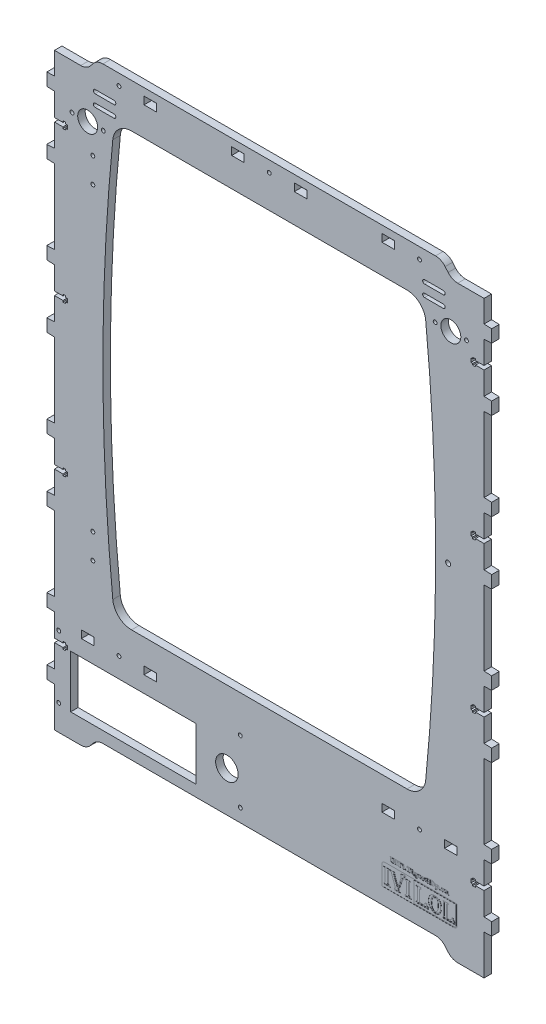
from build123d import *

# Parameters (mm, degrees)
SKETCH_1_R          = 1.55
SKETCH_1_R_2        = 7.95
SKETCH_1_W          = 10
SKETCH_1_H          = 6.1
EXTRUDE_1_DEPTH     = 6
SKETCH_2_R          = 9
SKETCH_2_R_2        = 1.55
SKETCH_2_W          = 100
SKETCH_2_H          = 42
CUT_EXTRUDE_1_DEPTH = 512.837630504
CUT_EXTRUDE_2_DEPTH = 512.837630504
CUT_EXTRUDE_3_DEPTH = 0.1
CUT_EXTRUDE_4_DEPTH = 0.1
SKETCH_7_R          = 1.55
CUT_EXTRUDE_5_DEPTH = 512.837630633
SKETCH_8_R          = 2
CUT_EXTRUDE_6_DEPTH = 512.837630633


with BuildPart() as part:
    # Sketch 1 → Extrude 1 (new body)
    with BuildSketch(Plane.XY):
        with BuildLine():
            Line((171.5, 92.25), (177.6, 92))
            Line((177.6, 92), (177.6, 82))
            Line((177.6, 82), (171.5, 81.75))
            Line((171.5, 81.75), (171.5, 63.55))
            Line((171.5, 63.55), (164.700039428, 63.55))
            Line((164.700039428, 63.55), (164.700039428, 64.75))
            Line((164.700039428, 64.75), (162.5, 64.75))
            Line((162.5, 64.75), (162.5, 63.55))
            Line((162.5, 63.55), (161, 63.55))
            Line((161, 63.55), (161, 60.45))
            Line((161, 60.45), (162.5, 60.45))
            Line((162.5, 60.45), (162.5, 59.25))
            Line((162.5, 59.25), (164.700039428, 59.25))
            Line((164.700039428, 59.25), (164.700039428, 60.45))
            Line((164.700039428, 60.45), (171.5, 60.45))
            Line((171.5, 60.45), (171.5, 42.25))
            Line((171.5, 42.25), (177.6, 42))
            Line((177.6, 42), (177.6, 32))
            Line((177.6, 32), (171.5, 31.75))
            Line((171.5, 31.75), (171.5, 0))
            Line((171.5, 0), (150.5, 0))
            ThreePointArc((150.5, 0), (146.273817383, 0.93692213), (142.839555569, 3.572123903))
            Line((142.839555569, 3.572123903), (140.443294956, 6.427876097))
            ThreePointArc((140.443294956, 6.427876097), (137.009033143, 9.06307787), (132.782850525, 10))
            Line((132.782850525, 10), (-132.782850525, 10))
            ThreePointArc((-132.782850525, 10), (-137.009033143, 9.06307787), (-140.443294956, 6.427876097))
            Line((-140.443294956, 6.427876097), (-142.839555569, 3.572123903))
            ThreePointArc((-142.839555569, 3.572123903), (-146.273817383, 0.93692213), (-150.5, 0))
            Line((-150.5, 0), (-171.5, 0))
            Line((-171.5, 0), (-171.5, 31.75))
            Line((-171.5, 31.75), (-177.6, 32))
            Line((-177.6, 32), (-177.6, 42))
            Line((-177.6, 42), (-171.5, 42.25))
            Line((-171.5, 42.25), (-171.5, 60.45))
            Line((-171.5, 60.45), (-164.700039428, 60.45))
            Line((-164.700039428, 60.45), (-164.700039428, 59.25))
            Line((-164.700039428, 59.25), (-162.5, 59.25))
            Line((-162.5, 59.25), (-162.5, 60.45))
            Line((-162.5, 60.45), (-161, 60.45))
            Line((-161, 60.45), (-161, 63.55))
            Line((-161, 63.55), (-162.5, 63.55))
            Line((-162.5, 63.55), (-162.5, 64.75))
            Line((-162.5, 64.75), (-164.700039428, 64.75))
            Line((-164.700039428, 64.75), (-164.700039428, 63.55))
            Line((-164.700039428, 63.55), (-171.5, 63.55))
            Line((-171.5, 63.55), (-171.5, 81.75))
            Line((-171.5, 81.75), (-177.6, 82))
            Line((-177.6, 82), (-177.6, 92))
            Line((-177.6, 92), (-171.5, 92.25))
            Line((-171.5, 92.25), (-171.5, 151.75))
            Line((-171.5, 151.75), (-177.6, 152))
            Line((-177.6, 152), (-177.6, 162))
            Line((-177.6, 162), (-171.5, 162.25))
            Line((-171.5, 162.25), (-171.5, 180.45))
            Line((-171.5, 180.45), (-164.700039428, 180.45))
            Line((-164.700039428, 180.45), (-164.700039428, 179.25))
            Line((-164.700039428, 179.25), (-162.5, 179.25))
            Line((-162.5, 179.25), (-162.5, 180.45))
            Line((-162.5, 180.45), (-161, 180.45))
            Line((-161, 180.45), (-161, 183.55))
            Line((-161, 183.55), (-162.5, 183.55))
            Line((-162.5, 183.55), (-162.5, 184.75))
            Line((-162.5, 184.75), (-164.700039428, 184.75))
            Line((-164.700039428, 184.75), (-164.700039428, 183.55))
            Line((-164.700039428, 183.55), (-171.5, 183.55))
            Line((-171.5, 183.55), (-171.5, 201.75))
            Line((-171.5, 201.75), (-177.6, 202))
            Line((-177.6, 202), (-177.6, 212))
            Line((-177.6, 212), (-171.5, 212.25))
            Line((-171.5, 212.25), (-171.5, 271.75))
            Line((-171.5, 271.75), (-177.6, 272))
            Line((-177.6, 272), (-177.6, 282))
            Line((-177.6, 282), (-171.5, 282.25))
            Line((-171.5, 282.25), (-171.5, 300.45))
            Line((-171.5, 300.45), (-164.700039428, 300.45))
            Line((-164.700039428, 300.45), (-164.700039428, 299.25))
            Line((-164.700039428, 299.25), (-162.5, 299.25))
            Line((-162.5, 299.25), (-162.5, 300.45))
            Line((-162.5, 300.45), (-161, 300.45))
            Line((-161, 300.45), (-161, 303.55))
            Line((-161, 303.55), (-162.5, 303.55))
            Line((-162.5, 303.55), (-162.5, 304.75))
            Line((-162.5, 304.75), (-164.700039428, 304.75))
            Line((-164.700039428, 304.75), (-164.700039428, 303.55))
            Line((-164.700039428, 303.55), (-171.5, 303.55))
            Line((-171.5, 303.55), (-171.5, 321.75))
            Line((-171.5, 321.75), (-177.6, 322))
            Line((-177.6, 322), (-177.6, 332))
            Line((-177.6, 332), (-171.5, 332.25))
            Line((-171.5, 332.25), (-171.5, 391.75))
            Line((-171.5, 391.75), (-177.6, 392))
            Line((-177.6, 392), (-177.6, 402))
            Line((-177.6, 402), (-171.5, 402.25))
            Line((-171.5, 402.25), (-171.5, 420.45))
            Line((-171.5, 420.45), (-164.700039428, 420.45))
            Line((-164.700039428, 420.45), (-164.700039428, 419.25))
            Line((-164.700039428, 419.25), (-162.5, 419.25))
            Line((-162.5, 419.25), (-162.5, 420.45))
            Line((-162.5, 420.45), (-161, 420.45))
            Line((-161, 420.45), (-161, 423.55))
            Line((-161, 423.55), (-162.5, 423.55))
            Line((-162.5, 423.55), (-162.5, 424.75))
            Line((-162.5, 424.75), (-164.700039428, 424.75))
            Line((-164.700039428, 424.75), (-164.700039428, 423.55))
            Line((-164.700039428, 423.55), (-171.5, 423.55))
            Line((-171.5, 423.55), (-171.5, 441.75))
            Line((-171.5, 441.75), (-177.6, 442))
            Line((-177.6, 442), (-177.6, 452))
            Line((-177.6, 452), (-171.5, 452.25))
            Line((-171.5, 452.25), (-171.5, 470))
            Line((-171.5, 470), (-150.5, 470))
            ThreePointArc((-150.5, 470), (-146.273817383, 470.93692213), (-142.839555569, 473.572123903))
            Line((-142.839555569, 473.572123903), (-140.443294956, 476.427876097))
            ThreePointArc((-140.443294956, 476.427876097), (-137.009033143, 479.06307787), (-132.782850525, 480))
            Line((-132.782850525, 480), (132.782850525, 480))
            ThreePointArc((132.782850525, 480), (137.009033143, 479.06307787), (140.443294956, 476.427876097))
            Line((140.443294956, 476.427876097), (142.839555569, 473.572123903))
            ThreePointArc((142.839555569, 473.572123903), (146.273817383, 470.93692213), (150.5, 470))
            Line((150.5, 470), (171.5, 470))
            Line((171.5, 470), (171.5, 452.25))
            Line((171.5, 452.25), (177.6, 452))
            Line((177.6, 452), (177.6, 442))
            Line((177.6, 442), (171.5, 441.75))
            Line((171.5, 441.75), (171.5, 423.55))
            Line((171.5, 423.55), (164.700039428, 423.55))
            Line((164.700039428, 423.55), (164.700039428, 424.75))
            Line((164.700039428, 424.75), (162.5, 424.75))
            Line((162.5, 424.75), (162.5, 423.55))
            Line((162.5, 423.55), (161, 423.55))
            Line((161, 423.55), (161, 420.45))
            Line((161, 420.45), (162.5, 420.45))
            Line((162.5, 420.45), (162.5, 419.25))
            Line((162.5, 419.25), (164.700039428, 419.25))
            Line((164.700039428, 419.25), (164.700039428, 420.45))
            Line((164.700039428, 420.45), (171.5, 420.45))
            Line((171.5, 420.45), (171.5, 402.25))
            Line((171.5, 402.25), (177.6, 402))
            Line((177.6, 402), (177.6, 392))
            Line((177.6, 392), (171.5, 391.75))
            Line((171.5, 391.75), (171.5, 332.25))
            Line((171.5, 332.25), (177.6, 332))
            Line((177.6, 332), (177.6, 322))
            Line((177.6, 322), (171.5, 321.75))
            Line((171.5, 321.75), (171.5, 303.55))
            Line((171.5, 303.55), (164.700039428, 303.55))
            Line((164.700039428, 303.55), (164.700039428, 304.75))
            Line((164.700039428, 304.75), (162.5, 304.75))
            Line((162.5, 304.75), (162.5, 303.55))
            Line((162.5, 303.55), (161, 303.55))
            Line((161, 303.55), (161, 300.45))
            Line((161, 300.45), (162.5, 300.45))
            Line((162.5, 300.45), (162.5, 299.25))
            Line((162.5, 299.25), (164.700039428, 299.25))
            Line((164.700039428, 299.25), (164.700039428, 300.45))
            Line((164.700039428, 300.45), (171.5, 300.45))
            Line((171.5, 300.45), (171.5, 282.25))
            Line((171.5, 282.25), (177.6, 282))
            Line((177.6, 282), (177.6, 272))
            Line((177.6, 272), (171.5, 271.75))
            Line((171.5, 271.75), (171.5, 212.25))
            Line((171.5, 212.25), (177.6, 212))
            Line((177.6, 212), (177.6, 202))
            Line((177.6, 202), (171.5, 201.75))
            Line((171.5, 201.75), (171.5, 183.55))
            Line((171.5, 183.55), (164.700039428, 183.55))
            Line((164.700039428, 183.55), (164.700039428, 184.75))
            Line((164.700039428, 184.75), (162.5, 184.75))
            Line((162.5, 184.75), (162.5, 183.55))
            Line((162.5, 183.55), (161, 183.55))
            Line((161, 183.55), (161, 180.45))
            Line((161, 180.45), (162.5, 180.45))
            Line((162.5, 180.45), (162.5, 179.25))
            Line((162.5, 179.25), (164.700039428, 179.25))
            Line((164.700039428, 179.25), (164.700039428, 180.45))
            Line((164.700039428, 180.45), (171.5, 180.45))
            Line((171.5, 180.45), (171.5, 162.25))
            Line((171.5, 162.25), (177.6, 162))
            Line((177.6, 162), (177.6, 152))
            Line((177.6, 152), (171.5, 151.75))
            Line((171.5, 151.75), (171.5, 92.25))
        make_face()
        with Locations(Location((157.5, 434, 0), (0, 0, 180))):
            Circle(SKETCH_1_R, mode=Mode.SUBTRACT)
        with Locations(Location((145, 434, 0), (0, 0, 180))):
            Circle(SKETCH_1_R_2, mode=Mode.SUBTRACT)
        with Locations(Location((120, 77, 0), (0, 0, 180))):
            Circle(SKETCH_1_R, mode=Mode.SUBTRACT)
        with Locations((0, 471.1)):
            Circle(SKETCH_1_R, mode=Mode.SUBTRACT)
        with Locations((-120, 77)):
            Circle(SKETCH_1_R, mode=Mode.SUBTRACT)
        with Locations(Location((120, 471.1, 0), (0, 0, 180))):
            Circle(SKETCH_1_R, mode=Mode.SUBTRACT)
        with Locations(Location((132.5, 434, 0), (0, 0, 180))):
            Circle(SKETCH_1_R, mode=Mode.SUBTRACT)
        with Locations((-132.5, 434)):
            Circle(SKETCH_1_R, mode=Mode.SUBTRACT)
        with Locations((-120, 471.1)):
            Circle(SKETCH_1_R, mode=Mode.SUBTRACT)
        with Locations((-145, 434)):
            Circle(SKETCH_1_R_2, mode=Mode.SUBTRACT)
        with Locations((-157.5, 434)):
            Circle(SKETCH_1_R, mode=Mode.SUBTRACT)
        with Locations((95, 77)):
            Rectangle(SKETCH_1_W, SKETCH_1_H, mode=Mode.SUBTRACT)
        with Locations((145, 77)):
            Rectangle(SKETCH_1_W, SKETCH_1_H, mode=Mode.SUBTRACT)
        with BuildLine():
            Line((-110, 445), (110, 445))
            ThreePointArc((110, 445), (120.065832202, 441.121107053), (124.925759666, 431.490536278))
            ThreePointArc((124.925759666, 431.490536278), (132.844728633, 272.5), (124.925759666, 113.509463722))
            ThreePointArc((124.925759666, 113.509463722), (120.065832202, 103.878892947), (110, 100))
            Line((110, 100), (-110, 100))
            ThreePointArc((-110, 100), (-120.065832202, 103.878892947), (-124.925759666, 113.509463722))
            ThreePointArc((-124.925759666, 113.509463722), (-132.844728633, 272.5), (-124.925759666, 431.490536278))
            ThreePointArc((-124.925759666, 431.490536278), (-120.065832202, 441.121107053), (-110, 445))
        make_face(mode=Mode.SUBTRACT)
        with Locations((95, 471.1)):
            Rectangle(SKETCH_1_W, SKETCH_1_H, mode=Mode.SUBTRACT)
        with Locations((-25, 471.1)):
            Rectangle(SKETCH_1_W, SKETCH_1_H, mode=Mode.SUBTRACT)
        with Locations((25, 471.1)):
            Rectangle(SKETCH_1_W, SKETCH_1_H, mode=Mode.SUBTRACT)
        with Locations((-95, 471.1)):
            Rectangle(SKETCH_1_W, SKETCH_1_H, mode=Mode.SUBTRACT)
        with Locations((-145, 77)):
            Rectangle(SKETCH_1_W, SKETCH_1_H, mode=Mode.SUBTRACT)
        with Locations((-95, 77)):
            Rectangle(SKETCH_1_W, SKETCH_1_H, mode=Mode.SUBTRACT)
    extrude(amount=-EXTRUDE_1_DEPTH)

    # Sketch 2 → Cut-Extrude 1 (cut, through all)
    with BuildSketch(Plane.XY):
        with Locations((-33.8, 42.5)):
            Circle(SKETCH_2_R)
        with Locations((-168.1, 70.5)):
            Circle(SKETCH_2_R_2)
        with Locations((-23.1, 70.5)):
            Circle(SKETCH_2_R_2)
        with Locations((-23.1, 20.5)):
            Circle(SKETCH_2_R_2)
        with Locations((-168.1, 20.5)):
            Circle(SKETCH_2_R_2)
        with Locations((-108.6, 40)):
            Rectangle(SKETCH_2_W, SKETCH_2_H)
    extrude(amount=-CUT_EXTRUDE_1_DEPTH, mode=Mode.SUBTRACT)

    # Sketch 3 → Cut-Extrude 2 (cut, through all)
    with BuildSketch(Plane.XY):
        with BuildLine():
            Line((-139, 459.2), (-124, 459.2))
            ThreePointArc((-124, 459.2), (-122.5, 457.7), (-124, 456.2))
            Line((-124, 456.2), (-139, 456.2))
            ThreePointArc((-139, 456.2), (-140.5, 457.7), (-139, 459.2))
        make_face()
        with BuildLine():
            Line((-139, 446.8), (-124, 446.8))
            ThreePointArc((-124, 446.8), (-122.5, 448.3), (-124, 449.8))
            Line((-124, 449.8), (-139, 449.8))
            ThreePointArc((-139, 449.8), (-140.5, 448.3), (-139, 446.8))
        make_face()
        with BuildLine():
            Line((139, 446.8), (124, 446.8))
            ThreePointArc((124, 446.8), (122.5, 448.3), (124, 449.8))
            Line((124, 449.8), (139, 449.8))
            ThreePointArc((139, 449.8), (140.5, 448.3), (139, 446.8))
        make_face()
        with BuildLine():
            Line((139, 459.2), (124, 459.2))
            ThreePointArc((124, 459.2), (122.5, 457.7), (124, 456.2))
            Line((124, 456.2), (139, 456.2))
            ThreePointArc((139, 456.2), (140.5, 457.7), (139, 459.2))
        make_face()
    extrude(amount=-CUT_EXTRUDE_2_DEPTH, mode=Mode.SUBTRACT)

    # Sketch 5 → Cut-Extrude 3 (cut)
    # profile 1 of 8: a face of its own
    with BuildSketch(Plane.XY):
        with BuildLine():
            Line((150, 40.403486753), (150, 24.922486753))
            add(Edge.make_bspline(
                [(150, 24.922486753), (150, 23.812736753), (149.01145, 22.903386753), (147.8049, 22.903386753)],
                knots=[0.142857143, 0.142857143, 0.142857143, 0.142857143, 0.285714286, 0.285714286, 0.285714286, 0.285714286], degree=3))
            Line((147.8049, 22.903386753), (90, 22.903386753))
            Line((90, 22.903386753), (90, 38.384386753))
            add(Edge.make_bspline(
                [(90, 38.384386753), (90, 39.494686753), (90.9878, 40.403486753), (92.1951, 40.403486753)],
                knots=[0.571428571, 0.571428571, 0.571428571, 0.571428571, 0.714285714, 0.714285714, 0.714285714, 0.714285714], degree=3))
            Line((92.1951, 40.403486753), (150, 40.403486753))
        make_face()
        with BuildLine():
            Line((149.26845, 39.730386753), (149.26845, 24.922486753))
            add(Edge.make_bspline(
                [(149.26845, 24.922486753), (149.26845, 24.182786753), (148.6096, 23.576486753), (147.8049, 23.576486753)],
                knots=[0.166666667, 0.166666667, 0.166666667, 0.166666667, 0.333333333, 0.333333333, 0.333333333, 0.333333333], degree=3))
            add(Edge.make_bspline(
                [(147.8049, 23.576486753), (136.6137, 23.576486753), (126.673, 23.576486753), (115.4817, 23.576486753)],
                knots=[0.333333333, 0.333333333, 0.333333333, 0.333333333, 0.5, 0.5, 0.5, 0.5], degree=3))
            Line((115.4817, 23.576486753), (115.4817, 39.730386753))
            Line((115.4817, 39.730386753), (149.26845, 39.730386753))
        make_face(mode=Mode.SUBTRACT)
        Polygon((91.3331, 37.213136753), (95.54345, 37.213136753), (94.35135, 36.016636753), (94.35135, 26.864136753), (95.4706, 25.931486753), (91.3331, 25.931486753), (92.5677, 26.942136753), (92.5677, 36.112536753), align=None, mode=Mode.SUBTRACT)
        Polygon((95.9499, 36.712336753), (95.0429, 35.821686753), (95.0429, 26.861186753), (96.5354, 25.211786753), (91.92765, 25.211786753), (91.7062, 25.445636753), (96.0106, 25.445636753), (94.80635, 26.774236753), (94.80635, 35.902686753), (95.7982, 36.886236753), align=None, mode=Mode.SUBTRACT)
        with BuildLine():
            Line((108.7569, 39.990036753), (108.857, 39.894136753))
            add(Edge.make_bspline(
                [(108.857, 39.894136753), (108.0805, 39.153436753), (107.4465, 38.361736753), (106.95505, 37.518986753)],
                knots=[0.041666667, 0.041666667, 0.041666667, 0.041666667, 0.083333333, 0.083333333, 0.083333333, 0.083333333], degree=3))
            add(Edge.make_bspline(
                [(106.95505, 37.518986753), (106.4606, 36.673336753), (105.87215, 35.356886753), (105.18665, 33.563536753)],
                knots=[0.083333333, 0.083333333, 0.083333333, 0.083333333, 0.125, 0.125, 0.125, 0.125], degree=3))
            Line((105.18665, 33.563536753), (102.59005, 26.846136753))
            Line((102.59005, 26.846136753), (103.64875, 25.931486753))
            Line((103.64875, 25.931486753), (99.55055, 25.931486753))
            Line((99.55055, 25.931486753), (100.7245, 26.888136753))
            Line((100.7245, 26.888136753), (97.4727, 36.052586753))
            Line((97.4727, 36.052586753), (96.1016, 37.213136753))
            Line((96.1016, 37.213136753), (100.51215, 37.213136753))
            Line((100.51215, 37.213136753), (99.2563, 35.971636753))
            Line((99.2563, 35.971636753), (102.1896, 27.715786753))
            Line((102.1896, 27.715786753), (102.53545, 28.531536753))
            Line((102.53545, 28.531536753), (99.9146, 35.848636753))
            Line((99.9146, 35.848636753), (100.82155, 36.739336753))
            Line((100.82155, 36.739336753), (100.9823, 36.571436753))
            Line((100.9823, 36.571436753), (100.1906, 35.794686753))
            Line((100.1906, 35.794686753), (102.65375, 28.840336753))
            Line((102.65375, 28.840336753), (104.53145, 33.818436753))
            add(Edge.make_bspline(
                [(104.53145, 33.818436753), (105.0926, 35.293836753), (105.3747, 36.328486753), (105.3747, 36.922286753)],
                knots=[0.791666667, 0.791666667, 0.791666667, 0.791666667, 0.833333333, 0.833333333, 0.833333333, 0.833333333], degree=3))
            add(Edge.make_bspline(
                [(105.3747, 36.922286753), (105.3747, 37.518986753), (105.15325, 38.031836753), (104.7134, 38.460686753)],
                knots=[0.833333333, 0.833333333, 0.833333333, 0.833333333, 0.875, 0.875, 0.875, 0.875], degree=3))
            Line((104.7134, 38.460686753), (104.88325, 38.496636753))
            add(Edge.make_bspline(
                [(104.88325, 38.496636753), (106.60625, 38.823536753), (107.8985, 39.321336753), (108.7569, 39.990036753)],
                knots=[0.916666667, 0.916666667, 0.916666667, 0.916666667, 1, 1, 1, 1], degree=3))
        make_face(mode=Mode.SUBTRACT)
        with BuildLine():
            Line((109.2392, 39.453286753), (109.3181, 39.252386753))
            add(Edge.make_bspline(
                [(109.3181, 39.252386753), (108.18665, 38.376686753), (107.0188, 36.385486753), (105.81755, 33.272636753)],
                knots=[0.076923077, 0.076923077, 0.076923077, 0.076923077, 0.153846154, 0.153846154, 0.153846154, 0.153846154], degree=3))
            Line((105.81755, 33.272636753), (103.30895, 26.807186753))
            Line((103.30895, 26.807186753), (104.6952, 25.211786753))
            Line((104.6952, 25.211786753), (100.11175, 25.211786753))
            Line((100.11175, 25.211786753), (99.9146, 25.445636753))
            Line((99.9146, 25.445636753), (104.17345, 25.445636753))
            Line((104.17345, 25.445636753), (103.0511, 26.747136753))
            Line((103.0511, 26.747136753), (105.6022, 33.332586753))
            Line((105.6022, 33.332586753), (106.0815, 34.583186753))
            add(Edge.make_bspline(
                [(106.0815, 34.583186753), (106.5092, 35.659786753), (107.0127, 36.646336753), (107.5921, 37.539986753)],
                knots=[0.769230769, 0.769230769, 0.769230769, 0.769230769, 0.846153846, 0.846153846, 0.846153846, 0.846153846], degree=3))
            add(Edge.make_bspline(
                [(107.5921, 37.539986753), (108.1745, 38.433686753), (108.72355, 39.072386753), (109.2392, 39.453286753)],
                knots=[0.846153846, 0.846153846, 0.846153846, 0.846153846, 1, 1, 1, 1], degree=3))
        make_face(mode=Mode.SUBTRACT)
        Polygon((108.1745, 37.213136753), (112.38485, 37.213136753), (111.19275, 36.016636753), (111.19275, 26.864136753), (112.31205, 25.931486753), (108.1745, 25.931486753), (109.40915, 26.942136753), (109.40915, 36.112536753), align=None, mode=Mode.SUBTRACT)
        Polygon((112.79135, 36.712336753), (111.88435, 35.821686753), (111.88435, 26.861186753), (113.3768, 25.211786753), (108.76905, 25.211786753), (108.54765, 25.445636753), (112.852, 25.445636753), (111.64775, 26.774236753), (111.64775, 35.902686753), (112.63965, 36.886236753), align=None, mode=Mode.SUBTRACT)
    # profile 2 of 8: a face of its own
    with BuildSketch(Plane.XY):
        with BuildLine():
            Line((117.1857, 37.213136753), (121.4294, 37.213136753))
            Line((121.4294, 37.213136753), (120.17655, 36.007586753))
            Line((120.17655, 36.007586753), (120.17655, 26.606236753))
            Line((120.17655, 26.606236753), (120.24935, 26.606236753))
            Line((120.24935, 26.606236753), (120.5679, 26.579236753))
            Line((120.5679, 26.579236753), (120.6498, 26.579236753))
            Line((120.6498, 26.579236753), (120.6498, 35.920636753))
            Line((120.6498, 35.920636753), (121.6053, 36.880336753))
            Line((121.6053, 36.880336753), (121.7297, 36.685336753))
            Line((121.7297, 36.685336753), (120.8682, 35.812686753))
            Line((120.8682, 35.812686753), (120.8682, 26.579236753))
            add(Edge.make_bspline(
                [(120.8682, 26.579236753), (121.13515, 26.555236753), (121.38995, 26.543286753), (121.6326, 26.543286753)],
                knots=[0.55, 0.55, 0.55, 0.55, 0.6, 0.6, 0.6, 0.6], degree=3))
            add(Edge.make_bspline(
                [(121.6326, 26.543286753), (122.57595, 26.543286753), (123.28585, 26.750186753), (123.77115, 27.164036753)],
                knots=[0.6, 0.6, 0.6, 0.6, 0.65, 0.65, 0.65, 0.65], degree=3))
            add(Edge.make_bspline(
                [(123.77115, 27.164036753), (124.2534, 27.577836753), (124.57805, 28.258586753), (124.7418, 29.206236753)],
                knots=[0.65, 0.65, 0.65, 0.65, 0.7, 0.7, 0.7, 0.7], degree=3))
            add(Edge.make_bspline(
                [(124.7418, 29.206236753), (125.29995, 27.607886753), (125.8702, 26.516236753), (126.4587, 25.931486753)],
                knots=[0.7, 0.7, 0.7, 0.7, 0.75, 0.75, 0.75, 0.75], degree=3))
            Line((126.4587, 25.931486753), (117.1857, 25.931486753))
            Line((117.1857, 25.931486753), (118.41115, 26.921136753))
            Line((118.41115, 26.921136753), (118.41115, 36.094636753))
            Line((118.41115, 36.094636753), (117.1857, 37.213136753))
        make_face()
    # profile 3 of 8: a face of its own
    with BuildSketch(Plane.XY):
        with BuildLine():
            Line((127.3415, 26.000436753), (126.94105, 25.211786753))
            Line((126.94105, 25.211786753), (117.6619, 25.211786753))
            Line((117.6619, 25.211786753), (117.4405, 25.445636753))
            Line((117.4405, 25.445636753), (126.84395, 25.445636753))
            Line((126.84395, 25.445636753), (127.10185, 26.000436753))
            add(Edge.make_bspline(
                [(127.10185, 26.000436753), (126.4496, 26.792136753), (125.9279, 27.673836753), (125.53655, 28.645486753)],
                knots=[0.416666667, 0.416666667, 0.416666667, 0.416666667, 0.5, 0.5, 0.5, 0.5], degree=3))
            Line((125.53655, 28.645486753), (125.5002, 28.741386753))
            Line((125.5002, 28.741386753), (125.78535, 28.636436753))
            Line((125.78535, 28.636436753), (125.849, 28.486536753))
            add(Edge.make_bspline(
                [(125.849, 28.486536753), (126.2464, 27.619886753), (126.71955, 26.819136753), (127.26865, 26.087486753)],
                knots=[0.75, 0.75, 0.75, 0.75, 0.833333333, 0.833333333, 0.833333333, 0.833333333], degree=3))
            Line((127.26865, 26.087486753), (127.3415, 26.000436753))
        make_face()
    # profile 4 of 8: a face of its own
    with BuildSketch(Plane.XY):
        with BuildLine():
            Line((129.62555, 26.108436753), (129.62555, 26.153436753))
            add(Edge.make_bspline(
                [(129.62555, 26.153436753), (130.35965, 25.622586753), (131.2818, 25.355736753), (132.3921, 25.355736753)],
                knots=[0.461538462, 0.461538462, 0.461538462, 0.461538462, 0.538461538, 0.538461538, 0.538461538, 0.538461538], degree=3))
            add(Edge.make_bspline(
                [(132.3921, 25.355736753), (133.8814, 25.355736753), (135.10385, 25.910536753), (136.0594, 27.017036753)],
                knots=[0.538461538, 0.538461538, 0.538461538, 0.538461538, 0.615384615, 0.615384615, 0.615384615, 0.615384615], degree=3))
            add(Edge.make_bspline(
                [(136.0594, 27.017036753), (137.0149, 28.123686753), (137.4912, 29.539086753), (137.4912, 31.263436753)],
                knots=[0.615384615, 0.615384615, 0.615384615, 0.615384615, 0.692307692, 0.692307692, 0.692307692, 0.692307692], degree=3))
            add(Edge.make_bspline(
                [(137.4912, 31.263436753), (137.4912, 32.543936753), (137.2728, 33.668486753), (136.836, 34.628186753)],
                knots=[0.692307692, 0.692307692, 0.692307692, 0.692307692, 0.769230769, 0.769230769, 0.769230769, 0.769230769], degree=3))
            add(Edge.make_bspline(
                [(136.836, 34.628186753), (136.39915, 35.590736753), (135.7773, 36.307486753), (134.9735, 36.781336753)],
                knots=[0.769230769, 0.769230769, 0.769230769, 0.769230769, 0.846153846, 0.846153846, 0.846153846, 0.846153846], degree=3))
            Line((134.9735, 36.781336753), (134.9735, 36.880336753))
            add(Edge.make_bspline(
                [(134.9735, 36.880336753), (135.8228, 36.475436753), (136.49625, 35.782686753), (136.9876, 34.805036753)],
                knots=[0, 0, 0, 0, 0.076923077, 0.076923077, 0.076923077, 0.076923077], degree=3))
            add(Edge.make_bspline(
                [(136.9876, 34.805036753), (137.48205, 33.827436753), (137.7278, 32.696886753), (137.7278, 31.413386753)],
                knots=[0.076923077, 0.076923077, 0.076923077, 0.076923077, 0.153846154, 0.153846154, 0.153846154, 0.153846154], degree=3))
            add(Edge.make_bspline(
                [(137.7278, 31.413386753), (137.7278, 29.527086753), (137.2424, 28.003736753), (136.2748, 26.843136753)],
                knots=[0.153846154, 0.153846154, 0.153846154, 0.153846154, 0.230769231, 0.230769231, 0.230769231, 0.230769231], degree=3))
            add(Edge.make_bspline(
                [(136.2748, 26.843136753), (135.3041, 25.682586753), (134.0301, 25.103836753), (132.45275, 25.103836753)],
                knots=[0.230769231, 0.230769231, 0.230769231, 0.230769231, 0.307692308, 0.307692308, 0.307692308, 0.307692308], degree=3))
            add(Edge.make_bspline(
                [(132.45275, 25.103836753), (131.44565, 25.103836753), (130.50225, 25.439736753), (129.62555, 26.108436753)],
                knots=[0.307692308, 0.307692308, 0.307692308, 0.307692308, 0.384615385, 0.384615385, 0.384615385, 0.384615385], degree=3))
        make_face()
    # profile 5 of 8: a face of its own
    with BuildSketch(Plane.XY):
        with BuildLine():
            Line((138.5044, 37.213136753), (142.7481, 37.213136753))
            Line((142.7481, 37.213136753), (141.49525, 36.007586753))
            Line((141.49525, 36.007586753), (141.49525, 26.606236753))
            Line((141.49525, 26.606236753), (141.56805, 26.606236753))
            Line((141.56805, 26.606236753), (141.8866, 26.579236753))
            Line((141.8866, 26.579236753), (141.9685, 26.579236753))
            Line((141.9685, 26.579236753), (141.9685, 35.920636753))
            Line((141.9685, 35.920636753), (142.924, 36.880336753))
            Line((142.924, 36.880336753), (143.0484, 36.685336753))
            Line((143.0484, 36.685336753), (142.1869, 35.812686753))
            Line((142.1869, 35.812686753), (142.1869, 26.579236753))
            add(Edge.make_bspline(
                [(142.1869, 26.579236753), (142.45385, 26.555236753), (142.70865, 26.543286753), (142.9513, 26.543286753)],
                knots=[0.55, 0.55, 0.55, 0.55, 0.6, 0.6, 0.6, 0.6], degree=3))
            add(Edge.make_bspline(
                [(142.9513, 26.543286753), (143.89465, 26.543286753), (144.60455, 26.750186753), (145.08985, 27.164036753)],
                knots=[0.6, 0.6, 0.6, 0.6, 0.65, 0.65, 0.65, 0.65], degree=3))
            add(Edge.make_bspline(
                [(145.08985, 27.164036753), (145.57215, 27.577836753), (145.89675, 28.258586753), (146.0605, 29.206236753)],
                knots=[0.65, 0.65, 0.65, 0.65, 0.7, 0.7, 0.7, 0.7], degree=3))
            add(Edge.make_bspline(
                [(146.0605, 29.206236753), (146.6187, 27.607886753), (147.1889, 26.516236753), (147.7774, 25.931486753)],
                knots=[0.7, 0.7, 0.7, 0.7, 0.75, 0.75, 0.75, 0.75], degree=3))
            Line((147.7774, 25.931486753), (138.5044, 25.931486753))
            Line((138.5044, 25.931486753), (139.72985, 26.921136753))
            Line((139.72985, 26.921136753), (139.72985, 36.094636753))
            Line((139.72985, 36.094636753), (138.5044, 37.213136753))
        make_face()
    # profile 6 of 8: a face of its own
    with BuildSketch(Plane.XY):
        with BuildLine():
            Line((148.6602, 26.000436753), (148.25975, 25.211786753))
            Line((148.25975, 25.211786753), (138.9806, 25.211786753))
            Line((138.9806, 25.211786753), (138.7592, 25.445636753))
            Line((138.7592, 25.445636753), (148.16265, 25.445636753))
            Line((148.16265, 25.445636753), (148.42055, 26.000436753))
            add(Edge.make_bspline(
                [(148.42055, 26.000436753), (147.76835, 26.792136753), (147.2466, 27.673836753), (146.85525, 28.645486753)],
                knots=[0.416666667, 0.416666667, 0.416666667, 0.416666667, 0.5, 0.5, 0.5, 0.5], degree=3))
            Line((146.85525, 28.645486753), (146.8189, 28.741386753))
            Line((146.8189, 28.741386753), (147.10405, 28.636436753))
            Line((147.10405, 28.636436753), (147.1677, 28.486536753))
            add(Edge.make_bspline(
                [(147.1677, 28.486536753), (147.5651, 27.619886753), (148.03825, 26.819136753), (148.5874, 26.087486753)],
                knots=[0.75, 0.75, 0.75, 0.75, 0.833333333, 0.833333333, 0.833333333, 0.833333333], degree=3))
            Line((148.5874, 26.087486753), (148.6602, 26.000436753))
        make_face()
    # profile 7 of 8: a face of its own
    with BuildSketch(Plane.XY):
        with BuildLine():
            add(Edge.make_bspline(
                [(132.1372, 37.321086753), (133.5812, 37.321086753), (134.73385, 36.781336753), (135.5953, 35.704786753)],
                knots=[0, 0, 0, 0, 0.111111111, 0.111111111, 0.111111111, 0.111111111], degree=3))
            add(Edge.make_bspline(
                [(135.5953, 35.704786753), (136.4598, 34.628186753), (136.8906, 33.185686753), (136.8906, 31.383386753)],
                knots=[0.111111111, 0.111111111, 0.111111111, 0.111111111, 0.222222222, 0.222222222, 0.222222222, 0.222222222], degree=3))
            add(Edge.make_bspline(
                [(136.8906, 31.383386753), (136.8906, 29.680036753), (136.46585, 28.321586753), (135.61355, 27.307936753)],
                knots=[0.222222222, 0.222222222, 0.222222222, 0.222222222, 0.333333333, 0.333333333, 0.333333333, 0.333333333], degree=3))
            add(Edge.make_bspline(
                [(135.61355, 27.307936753), (134.7611, 26.294386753), (133.61755, 25.787536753), (132.18275, 25.787536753)],
                knots=[0.333333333, 0.333333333, 0.333333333, 0.333333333, 0.444444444, 0.444444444, 0.444444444, 0.444444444], degree=3))
            add(Edge.make_bspline(
                [(132.18275, 25.787536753), (131.0482, 25.787536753), (130.0412, 26.144386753), (129.1554, 26.858136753)],
                knots=[0.444444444, 0.444444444, 0.444444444, 0.444444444, 0.555555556, 0.555555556, 0.555555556, 0.555555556], degree=3))
            add(Edge.make_bspline(
                [(129.1554, 26.858136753), (127.85715, 27.913736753), (127.208, 29.473136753), (127.208, 31.542286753)],
                knots=[0.555555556, 0.555555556, 0.555555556, 0.555555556, 0.666666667, 0.666666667, 0.666666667, 0.666666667], degree=3))
            add(Edge.make_bspline(
                [(127.208, 31.542286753), (127.208, 33.308686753), (127.65385, 34.715136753), (128.54265, 35.758736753)],
                knots=[0.666666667, 0.666666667, 0.666666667, 0.666666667, 0.777777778, 0.777777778, 0.777777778, 0.777777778], degree=3))
            add(Edge.make_bspline(
                [(128.54265, 35.758736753), (129.4314, 36.799286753), (130.63265, 37.321086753), (132.1372, 37.321086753)],
                knots=[0.777777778, 0.777777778, 0.777777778, 0.777777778, 1, 1, 1, 1], degree=3))
        make_face()
        with BuildLine():
            add(Edge.make_bspline(
                [(132.1372, 36.565386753), (130.12605, 36.565386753), (129.11905, 34.829086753), (129.11905, 31.356386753)],
                knots=[0, 0, 0, 0, 0.142857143, 0.142857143, 0.142857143, 0.142857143], degree=3))
            add(Edge.make_bspline(
                [(129.11905, 31.356386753), (129.11905, 28.147586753), (130.11095, 26.543286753), (132.09475, 26.543286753)],
                knots=[0.142857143, 0.142857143, 0.142857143, 0.142857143, 0.285714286, 0.285714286, 0.285714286, 0.285714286], degree=3))
            add(Edge.make_bspline(
                [(132.09475, 26.543286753), (133.0169, 26.543286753), (133.72065, 26.969086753), (134.203, 27.817786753)],
                knots=[0.285714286, 0.285714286, 0.285714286, 0.285714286, 0.428571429, 0.428571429, 0.428571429, 0.428571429], degree=3))
            add(Edge.make_bspline(
                [(134.203, 27.817786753), (134.6853, 28.669386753), (134.92495, 29.913986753), (134.92495, 31.551336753)],
                knots=[0.428571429, 0.428571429, 0.428571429, 0.428571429, 0.571428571, 0.571428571, 0.571428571, 0.571428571], degree=3))
            add(Edge.make_bspline(
                [(134.92495, 31.551336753), (134.92495, 33.401636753), (134.6914, 34.694136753), (134.22725, 35.425786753)],
                knots=[0.571428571, 0.571428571, 0.571428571, 0.571428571, 0.714285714, 0.714285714, 0.714285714, 0.714285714], degree=3))
            add(Edge.make_bspline(
                [(134.22725, 35.425786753), (133.73885, 36.184536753), (133.0442, 36.565386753), (132.1372, 36.565386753)],
                knots=[0.714285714, 0.714285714, 0.714285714, 0.714285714, 1, 1, 1, 1], degree=3))
        make_face(mode=Mode.SUBTRACT)
    # profile 8 of 8: a face of its own
    with BuildSketch(Plane.XY):
        with BuildLine():
            Line((134.04225, 35.251886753), (133.89055, 35.338836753))
            add(Edge.make_bspline(
                [(133.89055, 35.338836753), (133.3233, 35.653736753), (132.80155, 35.809636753), (132.32835, 35.809636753)],
                knots=[0.1, 0.1, 0.1, 0.1, 0.2, 0.2, 0.2, 0.2], degree=3))
            add(Edge.make_bspline(
                [(132.32835, 35.809636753), (130.7722, 35.809636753), (129.9926, 34.295236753), (129.9926, 31.263436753)],
                knots=[0.2, 0.2, 0.2, 0.2, 0.3, 0.3, 0.3, 0.3], degree=3))
            add(Edge.make_bspline(
                [(129.9926, 31.263436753), (129.9926, 29.044286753), (130.475, 27.574886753), (131.43655, 26.855136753)],
                knots=[0.3, 0.3, 0.3, 0.3, 0.4, 0.4, 0.4, 0.4], degree=3))
            Line((131.43655, 26.855136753), (131.3577, 26.768186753))
            add(Edge.make_bspline(
                [(131.3577, 26.768186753), (130.76615, 27.181986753), (130.3476, 27.727836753), (130.0958, 28.405586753)],
                knots=[0.5, 0.5, 0.5, 0.5, 0.6, 0.6, 0.6, 0.6], degree=3))
            add(Edge.make_bspline(
                [(130.0958, 28.405586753), (129.844, 29.080336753), (129.71965, 29.997986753), (129.71965, 31.149486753)],
                knots=[0.6, 0.6, 0.6, 0.6, 0.7, 0.7, 0.7, 0.7], degree=3))
            add(Edge.make_bspline(
                [(129.71965, 31.149486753), (129.71965, 34.400236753), (130.58415, 36.025586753), (132.31015, 36.025586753)],
                knots=[0.7, 0.7, 0.7, 0.7, 0.8, 0.8, 0.8, 0.8], degree=3))
            add(Edge.make_bspline(
                [(132.31015, 36.025586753), (133.0988, 36.025586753), (133.6752, 35.767686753), (134.04225, 35.251886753)],
                knots=[0.8, 0.8, 0.8, 0.8, 1, 1, 1, 1], degree=3))
        make_face()
    extrude(amount=-CUT_EXTRUDE_3_DEPTH, mode=Mode.SUBTRACT)

    # Sketch 6 → Cut-Extrude 4 (cut)
    # profile 1 of 18: a face of its own
    with BuildSketch(Plane.XY):
        with BuildLine():
            add(Edge.make_bspline(
                [(97.995703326, 44.297492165), (97.996145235, 44.264819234), (97.99699219, 44.202198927), (98.003269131, 44.111979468), (98.012452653, 44.029414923), (98.027210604, 43.954381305), (98.044885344, 43.886572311), (98.067475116, 43.826420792), (98.094422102, 43.774057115), (98.124657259, 43.728107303), (98.161537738, 43.689651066), (98.202668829, 43.655935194), (98.249837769, 43.627229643), (98.303140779, 43.605251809), (98.36144235, 43.586484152), (98.425420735, 43.574035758), (98.495038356, 43.566267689), (98.543315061, 43.565622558), (98.568402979, 43.565287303)],
                knots=[0, 0, 0, 0, 1.450723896, 2.780429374, 4.014588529, 5.136907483, 6.173267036, 7.123340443, 7.983182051, 8.784587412, 9.556098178, 10.339235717, 11.141350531, 11.997582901, 12.893634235, 13.85718266, 14.886443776, 16, 16, 16, 16], degree=3))
            add(Edge.make_bspline(
                [(98.568402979, 43.565287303), (98.598041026, 43.565645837), (98.655397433, 43.566339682), (98.738185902, 43.57386757), (98.814558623, 43.586857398), (98.884276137, 43.603948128), (98.947920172, 43.625981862), (99.004646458, 43.654053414), (99.055331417, 43.686716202), (99.099636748, 43.724702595), (99.138155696, 43.768570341), (99.170761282, 43.819144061), (99.198148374, 43.876151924), (99.220909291, 43.939238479), (99.238087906, 44.00904585), (99.250946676, 44.084926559), (99.258576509, 44.167453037), (99.259245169, 44.224558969), (99.259592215, 44.254197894)],
                knots=[0, 0, 0, 0, 1.254056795, 2.426887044, 3.513751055, 4.529861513, 5.461812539, 6.357902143, 7.201935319, 8.007337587, 8.819765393, 9.663798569, 10.545551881, 11.491199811, 12.496918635, 13.583782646, 14.745943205, 16, 16, 16, 16], degree=3))
            Line((99.259592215, 44.254197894), (99.259592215, 45.843173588))
            add(Edge.make_bspline(
                [(99.259592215, 45.843173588), (99.25937106, 45.874372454), (99.258975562, 45.930166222), (99.248321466, 46.003827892), (99.233970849, 46.058905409), (99.207861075, 46.097968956), (99.166677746, 46.119560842), (99.112772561, 46.132475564), (99.042058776, 46.140209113), (98.989464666, 46.141153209), (98.960330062, 46.141676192)],
                knots=[0, 0, 0, 0, 1.447692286, 2.58894699, 3.452112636, 4.075696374, 4.703151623, 5.556400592, 6.646363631, 8, 8, 8, 8], degree=3))
            Line((98.960330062, 46.141676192), (98.773481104, 46.141676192))
            Line((98.773481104, 46.141676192), (98.773481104, 46.627787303))
            Line((98.773481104, 46.627787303), (100.426258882, 46.627787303))
            Line((100.426258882, 46.627787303), (100.426258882, 46.141676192))
            Line((100.426258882, 46.141676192), (100.25232225, 46.141676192))
            add(Edge.make_bspline(
                [(100.25232225, 46.141676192), (100.222195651, 46.141090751), (100.167620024, 46.1400302), (100.093864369, 46.132914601), (100.038001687, 46.118408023), (99.994381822, 46.097862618), (99.967984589, 46.059005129), (99.951872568, 46.007155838), (99.941849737, 45.938476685), (99.940756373, 45.887011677), (99.940147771, 45.85836456)],
                knots=[0, 0, 0, 0, 1.413197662, 2.560068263, 3.458427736, 4.122450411, 4.758628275, 5.588179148, 6.657501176, 8, 8, 8, 8], degree=3))
            Line((99.940147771, 45.85836456), (99.940147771, 44.167609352))
            add(Edge.make_bspline(
                [(99.940147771, 44.167609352), (99.939184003, 44.122462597), (99.937306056, 44.034492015), (99.916872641, 43.907167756), (99.884934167, 43.788216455), (99.841132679, 43.676981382), (99.782759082, 43.574459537), (99.711487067, 43.48053164), (99.627967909, 43.394613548), (99.531403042, 43.317964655), (99.423230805, 43.249110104), (99.301971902, 43.191098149), (99.169756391, 43.14071709), (99.024882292, 43.100969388), (98.868821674, 43.069269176), (98.700596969, 43.046728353), (98.520782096, 43.032998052), (98.396770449, 43.031391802), (98.33294291, 43.030565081)],
                knots=[0, 0, 0, 0, 0.970255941, 1.89058946, 2.765060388, 3.615464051, 4.454335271, 5.294019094, 6.145050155, 7.024390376, 7.939862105, 8.896963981, 9.91033134, 10.979208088, 12.124033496, 13.333103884, 14.627375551, 16, 16, 16, 16], degree=3))
            add(Edge.make_bspline(
                [(98.33294291, 43.030565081), (98.274932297, 43.031365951), (98.162033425, 43.032924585), (97.997732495, 43.047114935), (97.843331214, 43.06839576), (97.698901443, 43.099744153), (97.564467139, 43.139257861), (97.440486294, 43.189352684), (97.326011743, 43.246531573), (97.222305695, 43.313488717), (97.129915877, 43.38900871), (97.048977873, 43.471759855), (96.980383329, 43.562132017), (96.925542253, 43.660610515), (96.88202142, 43.765843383), (96.85070672, 43.878493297), (96.832341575, 43.998636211), (96.830156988, 44.081209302), (96.82903666, 44.123555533)],
                knots=[0, 0, 0, 0, 1.32572345, 2.580091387, 3.766820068, 4.886041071, 5.955311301, 6.965488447, 7.938633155, 8.876087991, 9.780855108, 10.660756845, 11.516108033, 12.366018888, 13.230096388, 14.113284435, 15.032429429, 16, 16, 16, 16], degree=3))
            Line((96.82903666, 44.123555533), (96.82903666, 45.843173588))
            add(Edge.make_bspline(
                [(96.82903666, 45.843173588), (96.828299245, 45.873322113), (96.82697431, 45.927490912), (96.818341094, 45.999813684), (96.802053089, 46.054170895), (96.775914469, 46.094081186), (96.734261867, 46.117226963), (96.679903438, 46.132134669), (96.608739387, 46.140292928), (96.555868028, 46.141184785), (96.526736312, 46.141676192)],
                knots=[0, 0, 0, 0, 1.403093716, 2.520982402, 3.377792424, 4.02827462, 4.678863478, 5.539793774, 6.644445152, 8, 8, 8, 8], degree=3))
            Line((96.526736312, 46.141676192), (96.342925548, 46.141676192))
            Line((96.342925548, 46.141676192), (96.342925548, 46.627787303))
            Line((96.342925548, 46.627787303), (98.481814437, 46.627787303))
            Line((98.481814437, 46.627787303), (98.481814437, 46.141676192))
            Line((98.481814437, 46.141676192), (98.288129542, 46.141676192))
            add(Edge.make_bspline(
                [(98.288129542, 46.141676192), (98.259506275, 46.141198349), (98.207898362, 46.140336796), (98.138453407, 46.132136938), (98.085713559, 46.117065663), (98.044913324, 46.094208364), (98.020497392, 46.053842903), (98.006149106, 45.999561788), (97.996667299, 45.927541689), (97.996047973, 45.873337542), (97.995703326, 45.843173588)],
                knots=[0, 0, 0, 0, 1.350936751, 2.435746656, 3.286050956, 3.935747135, 4.581918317, 5.443645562, 6.577419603, 8, 8, 8, 8], degree=3))
            Line((97.995703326, 45.843173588), (97.995703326, 44.297492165))
        make_face()
    # profile 2 of 18: a face of its own
    with BuildSketch(Plane.XY):
        with BuildLine():
            add(Edge.make_bspline(
                [(100.863758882, 45.90241838), (100.863359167, 45.92499319), (100.862631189, 45.966107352), (100.853310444, 46.021667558), (100.837303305, 46.064987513), (100.812542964, 46.097600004), (100.776278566, 46.118951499), (100.728668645, 46.13245039), (100.668039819, 46.140137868), (100.62325949, 46.141130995), (100.598676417, 46.141676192)],
                knots=[0, 0, 0, 0, 1.269504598, 2.312073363, 3.156180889, 3.846078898, 4.569593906, 5.48001558, 6.616603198, 8, 8, 8, 8], degree=3))
            Line((100.598676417, 46.141676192), (100.474869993, 46.141676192))
            Line((100.474869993, 46.141676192), (100.474869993, 46.627787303))
            Line((100.474869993, 46.627787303), (101.933203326, 46.627787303))
            Line((101.933203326, 46.627787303), (101.933203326, 43.853156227))
            add(Edge.make_bspline(
                [(101.933203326, 43.853156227), (101.933809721, 43.830310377), (101.934909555, 43.788874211), (101.945335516, 43.732897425), (101.961658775, 43.688914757), (101.988461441, 43.655858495), (102.028569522, 43.635672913), (102.080898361, 43.623439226), (102.147663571, 43.615319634), (102.196991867, 43.614402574), (102.224110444, 43.613898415)],
                knots=[0, 0, 0, 0, 1.217008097, 2.207322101, 3.024692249, 3.695432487, 4.420627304, 5.370349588, 6.554331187, 8, 8, 8, 8], degree=3))
            Line((102.224110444, 43.613898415), (102.322092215, 43.613898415))
            Line((102.322092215, 43.613898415), (102.322092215, 43.127787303))
            Line((102.322092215, 43.127787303), (100.474869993, 43.127787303))
            Line((100.474869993, 43.127787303), (100.474869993, 43.613898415))
            Line((100.474869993, 43.613898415), (100.598676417, 43.613898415))
            add(Edge.make_bspline(
                [(100.598676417, 43.613898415), (100.623250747, 43.614456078), (100.668015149, 43.615471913), (100.728740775, 43.623021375), (100.77595645, 43.636862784), (100.813042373, 43.657139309), (100.837009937, 43.690602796), (100.853391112, 43.733833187), (100.862603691, 43.789492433), (100.86334942, 43.830590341), (100.863758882, 43.853156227)],
                knots=[0, 0, 0, 0, 1.3827462, 2.518799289, 3.428792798, 4.144495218, 4.845303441, 5.689013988, 6.731092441, 8, 8, 8, 8], degree=3))
            Line((100.863758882, 43.853156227), (100.863758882, 45.90241838))
        make_face()
    # profile 3 of 18: a face of its own
    with BuildSketch(Plane.XY):
        with BuildLine():
            add(Edge.make_bspline(
                [(103.475846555, 46.093065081), (103.453529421, 46.09252329), (103.409966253, 46.091465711), (103.346624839, 46.082008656), (103.286910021, 46.067449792), (103.23191381, 46.044397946), (103.179656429, 46.018045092), (103.133342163, 45.982467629), (103.089201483, 45.9433608), (103.050909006, 45.896501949), (103.016204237, 45.844504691), (102.987078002, 45.786293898), (102.960669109, 45.723132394), (102.940730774, 45.653694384), (102.924747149, 45.579079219), (102.913572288, 45.499120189), (102.906612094, 45.413646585), (102.905829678, 45.354798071), (102.905425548, 45.324401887)],
                knots=[0, 0, 0, 0, 0.985785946, 1.924259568, 2.825360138, 3.693981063, 4.554999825, 5.403270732, 6.266685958, 7.156458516, 8.068952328, 9.024877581, 10.028602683, 11.090821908, 12.212392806, 13.399330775, 14.656713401, 16, 16, 16, 16], degree=3))
            Line((102.905425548, 45.324401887), (102.905425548, 45.308451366))
            Line((102.905425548, 45.308451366), (102.370703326, 45.308451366))
            Line((102.370703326, 45.308451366), (102.370703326, 46.627787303))
            Line((102.370703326, 46.627787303), (106.065147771, 46.627787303))
            Line((106.065147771, 46.627787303), (106.065147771, 45.308451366))
            Line((106.065147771, 45.308451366), (105.530425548, 45.308451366))
            Line((105.530425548, 45.308451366), (105.530425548, 45.324401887))
            add(Edge.make_bspline(
                [(105.530425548, 45.324401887), (105.529987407, 45.354540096), (105.529135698, 45.413126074), (105.522577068, 45.498446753), (105.510093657, 45.577978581), (105.49465929, 45.652609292), (105.47312059, 45.72122704), (105.448640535, 45.785049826), (105.417558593, 45.842452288), (105.382974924, 45.894786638), (105.344038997, 45.941709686), (105.30044431, 45.982403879), (105.25238224, 46.016262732), (105.200893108, 46.045516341), (105.14437672, 46.065781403), (105.084634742, 46.082523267), (105.020271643, 46.09136794), (104.975978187, 46.092488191), (104.953168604, 46.093065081)],
                knots=[0, 0, 0, 0, 1.326827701, 2.579234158, 3.763102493, 4.869338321, 5.930578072, 6.92615912, 7.873592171, 8.797926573, 9.684177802, 10.551727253, 11.414681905, 12.267790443, 13.149685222, 14.050052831, 14.995845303, 16, 16, 16, 16], degree=3))
            Line((104.953168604, 46.093065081), (104.801258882, 46.093065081))
            Line((104.801258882, 46.093065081), (104.801258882, 43.917717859))
            add(Edge.make_bspline(
                [(104.801258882, 43.917717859), (104.801470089, 43.887022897), (104.801850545, 43.831730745), (104.812811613, 43.758446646), (104.826486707, 43.702494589), (104.851809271, 43.66167897), (104.892617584, 43.63828928), (104.945540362, 43.62481203), (105.013830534, 43.614789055), (105.064775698, 43.614215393), (105.092925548, 43.613898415)],
                knots=[0, 0, 0, 0, 1.437268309, 2.589013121, 3.468004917, 4.126540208, 4.772106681, 5.613579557, 6.681378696, 8, 8, 8, 8], degree=3))
            Line((105.092925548, 43.613898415), (105.384592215, 43.613898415))
            Line((105.384592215, 43.613898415), (105.384592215, 43.127787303))
            Line((105.384592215, 43.127787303), (103.051258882, 43.127787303))
            Line((103.051258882, 43.127787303), (103.051258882, 43.613898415))
            Line((103.051258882, 43.613898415), (103.335330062, 43.613898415))
            add(Edge.make_bspline(
                [(103.335330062, 43.613898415), (103.363174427, 43.614567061), (103.413925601, 43.615785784), (103.482793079, 43.622085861), (103.535558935, 43.635589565), (103.571537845, 43.650593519), (103.591050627, 43.670490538), (103.603211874, 43.689844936), (103.612671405, 43.714720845), (103.621242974, 43.74463541), (103.626736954, 43.78036917), (103.631244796, 43.821417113), (103.634430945, 43.867793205), (103.634536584, 43.900495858), (103.634592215, 43.917717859)],
                knots=[0, 0, 0, 0, 1.922815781, 3.504664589, 4.750336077, 5.687799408, 6.13247731, 6.650974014, 7.254336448, 7.962191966, 8.795024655, 9.74413394, 10.812006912, 12, 12, 12, 12], degree=3))
            Line((103.634592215, 43.917717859), (103.634592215, 46.093065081))
            Line((103.634592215, 46.093065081), (103.475846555, 46.093065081))
        make_face()
    # profile 4 of 18: a face of its own
    with BuildSketch(Plane.XY):
        with BuildLine():
            add(Edge.make_bspline(
                [(106.599869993, 46.261684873), (106.601360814, 46.293014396), (106.604272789, 46.354209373), (106.630642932, 46.442049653), (106.672789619, 46.522388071), (106.731632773, 46.592526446), (106.801804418, 46.650956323), (106.881038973, 46.69442401), (106.968410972, 46.720547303), (107.029089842, 46.72349854), (107.060156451, 46.725009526)],
                knots=[0, 0, 0, 0, 1.032498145, 2.016746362, 3.000390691, 4.009883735, 5.01937678, 5.999603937, 6.975829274, 8, 8, 8, 8], degree=3))
            add(Edge.make_bspline(
                [(107.060156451, 46.725009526), (107.091239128, 46.723550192), (107.152264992, 46.720685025), (107.2396965, 46.693619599), (107.319597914, 46.650086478), (107.390246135, 46.591004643), (107.449264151, 46.520353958), (107.492893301, 46.440801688), (107.519019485, 46.353430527), (107.521970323, 46.292751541), (107.523481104, 46.261684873)],
                knots=[0, 0, 0, 0, 1.022358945, 2.00723823, 2.985731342, 4.005190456, 5.024649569, 6.003142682, 6.977641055, 8, 8, 8, 8], degree=3))
            add(Edge.make_bspline(
                [(107.523481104, 46.261684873), (107.521951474, 46.230872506), (107.518951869, 46.170449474), (107.492867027, 46.083345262), (107.449460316, 46.003879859), (107.390219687, 45.933798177), (107.319342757, 45.875678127), (107.239859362, 45.831778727), (107.152114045, 45.805970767), (107.091212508, 45.802942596), (107.060156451, 45.801398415)],
                knots=[0, 0, 0, 0, 1.016894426, 1.994129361, 2.975370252, 3.991265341, 5.008263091, 5.989503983, 6.974770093, 8, 8, 8, 8], degree=3))
            add(Edge.make_bspline(
                [(107.060156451, 45.801398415), (107.028849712, 45.802969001), (106.96776931, 45.806033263), (106.880003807, 45.83113888), (106.800151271, 45.873033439), (106.730188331, 45.930645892), (106.672005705, 46.000240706), (106.630450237, 46.080370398), (106.604280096, 46.168416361), (106.601363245, 46.230104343), (106.599869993, 46.261684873)],
                knots=[0, 0, 0, 0, 1.033254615, 2.01591127, 2.988974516, 3.993891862, 4.992344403, 5.965407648, 6.958411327, 8, 8, 8, 8], degree=3))
        make_face()
    # profile 5 of 18: a face of its own
    with BuildSketch(Plane.XY):
        with BuildLine():
            add(Edge.make_bspline(
                [(107.717925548, 43.852396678), (107.718703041, 43.830099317), (107.72012591, 43.789293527), (107.728795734, 43.73364439), (107.746243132, 43.690535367), (107.77118201, 43.6565769), (107.810944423, 43.636755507), (107.86184007, 43.622953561), (107.927624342, 43.615500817), (107.976162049, 43.614465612), (108.002756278, 43.613898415)],
                knots=[0, 0, 0, 0, 1.207345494, 2.209529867, 3.026126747, 3.708543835, 4.432324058, 5.373090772, 6.560693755, 8, 8, 8, 8], degree=3))
            Line((108.002756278, 43.613898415), (108.106814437, 43.613898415))
            Line((108.106814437, 43.613898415), (108.106814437, 43.127787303))
            Line((108.106814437, 43.127787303), (106.259592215, 43.127787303))
            Line((106.259592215, 43.127787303), (106.259592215, 43.613898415))
            Line((106.259592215, 43.613898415), (106.369726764, 43.613898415))
            add(Edge.make_bspline(
                [(106.369726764, 43.613898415), (106.395816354, 43.614466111), (106.443348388, 43.615500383), (106.507619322, 43.622909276), (106.557309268, 43.636816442), (106.596015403, 43.656849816), (106.621121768, 43.69034588), (106.637103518, 43.733953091), (106.647617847, 43.789123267), (106.648176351, 43.830059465), (106.648481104, 43.852396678)],
                knots=[0, 0, 0, 0, 1.429096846, 2.603639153, 3.529228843, 4.249771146, 4.940484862, 5.761760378, 6.778683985, 8, 8, 8, 8], degree=3))
            Line((106.648481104, 43.852396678), (106.648481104, 44.882344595))
            add(Edge.make_bspline(
                [(106.648481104, 44.882344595), (106.648172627, 44.904938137), (106.647606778, 44.946382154), (106.637149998, 45.002019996), (106.621369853, 45.045883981), (106.595705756, 45.078608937), (106.557471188, 45.098877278), (106.507435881, 45.111492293), (106.443387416, 45.119360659), (106.395830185, 45.120317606), (106.369726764, 45.120842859)],
                knots=[0, 0, 0, 0, 1.233190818, 2.262079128, 3.082041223, 3.760869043, 4.480259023, 5.400524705, 6.57318863, 8, 8, 8, 8], degree=3))
            Line((106.369726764, 45.120842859), (106.259592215, 45.120842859))
            Line((106.259592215, 45.120842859), (106.259592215, 45.60695397))
            Line((106.259592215, 45.60695397), (107.717925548, 45.60695397))
            Line((107.717925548, 45.60695397), (107.717925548, 43.852396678))
        make_face()
    # profile 6 of 18: a face of its own
    with BuildSketch(Plane.XY):
        with BuildLine():
            add(Edge.make_bspline(
                [(108.495703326, 43.51819529), (108.497469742, 43.551029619), (108.500910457, 43.614985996), (108.527530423, 43.707072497), (108.57275354, 43.790559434), (108.634132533, 43.864347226), (108.708058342, 43.9259691), (108.792227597, 43.970940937), (108.885276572, 43.997658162), (108.949989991, 44.001043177), (108.983333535, 44.002787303)],
                knots=[0, 0, 0, 0, 1.028218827, 2.002816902, 2.975733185, 3.984783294, 4.993833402, 5.973748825, 6.955975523, 8, 8, 8, 8], degree=3))
            add(Edge.make_bspline(
                [(108.983333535, 44.002787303), (109.016418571, 44.001014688), (109.0808677, 43.99756166), (109.173494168, 43.971092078), (109.257172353, 43.925963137), (109.330204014, 43.864056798), (109.391898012, 43.790823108), (109.435649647, 43.706697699), (109.463964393, 43.615200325), (109.466583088, 43.551070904), (109.467925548, 43.51819529)],
                knots=[0, 0, 0, 0, 1.039136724, 2.024221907, 2.999969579, 4.005833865, 5.017820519, 5.989827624, 6.969495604, 8, 8, 8, 8], degree=3))
            add(Edge.make_bspline(
                [(109.467925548, 43.51819529), (109.466607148, 43.484810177), (109.464044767, 43.419924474), (109.435627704, 43.327463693), (109.392132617, 43.242652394), (109.330179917, 43.169308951), (109.257178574, 43.107385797), (109.173492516, 43.062261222), (109.080868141, 43.035790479), (109.016418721, 43.032337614), (108.983333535, 43.030565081)],
                knots=[0, 0, 0, 0, 1.042387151, 2.025933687, 3.001263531, 4.009401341, 5.01144007, 5.983476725, 6.964815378, 8, 8, 8, 8], degree=3))
            add(Edge.make_bspline(
                [(108.983333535, 43.030565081), (108.949989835, 43.032309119), (108.885276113, 43.035693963), (108.792229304, 43.062412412), (108.708051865, 43.107379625), (108.634157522, 43.169019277), (108.57251787, 43.24291362), (108.527550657, 43.327091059), (108.500832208, 43.420137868), (108.497447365, 43.48485159), (108.495703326, 43.51819529)],
                knots=[0, 0, 0, 0, 1.040067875, 2.01857217, 2.994773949, 4, 5.005226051, 5.98142783, 6.959932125, 8, 8, 8, 8], degree=3))
        make_face()
    # profile 7 of 18: a face of its own
    with BuildSketch(Plane.XY):
        with BuildLine():
            add(Edge.make_bspline(
                [(111.010568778, 46.093065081), (110.988251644, 46.09252329), (110.944688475, 46.091465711), (110.881347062, 46.082008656), (110.821632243, 46.067449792), (110.766636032, 46.044397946), (110.714378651, 46.018045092), (110.668064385, 45.982467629), (110.623923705, 45.9433608), (110.585631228, 45.896501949), (110.550926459, 45.844504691), (110.521800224, 45.786293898), (110.495391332, 45.723132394), (110.475452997, 45.653694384), (110.459469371, 45.579079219), (110.44829451, 45.499120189), (110.441334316, 45.413646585), (110.440551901, 45.354798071), (110.440147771, 45.324401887)],
                knots=[0, 0, 0, 0, 0.985785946, 1.924259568, 2.825360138, 3.693981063, 4.554999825, 5.403270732, 6.266685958, 7.156458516, 8.068952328, 9.024877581, 10.028602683, 11.090821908, 12.212392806, 13.399330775, 14.656713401, 16, 16, 16, 16], degree=3))
            Line((110.440147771, 45.324401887), (110.440147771, 45.308451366))
            Line((110.440147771, 45.308451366), (109.905425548, 45.308451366))
            Line((109.905425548, 45.308451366), (109.905425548, 46.627787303))
            Line((109.905425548, 46.627787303), (113.599869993, 46.627787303))
            Line((113.599869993, 46.627787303), (113.599869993, 45.308451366))
            Line((113.599869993, 45.308451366), (113.065147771, 45.308451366))
            Line((113.065147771, 45.308451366), (113.065147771, 45.324401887))
            add(Edge.make_bspline(
                [(113.065147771, 45.324401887), (113.064709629, 45.354540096), (113.06385792, 45.413126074), (113.05729929, 45.498446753), (113.04481588, 45.577978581), (113.029381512, 45.652609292), (113.007842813, 45.72122704), (112.983362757, 45.785049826), (112.952280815, 45.842452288), (112.917697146, 45.894786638), (112.87876122, 45.941709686), (112.835166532, 45.982403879), (112.787104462, 46.016262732), (112.735615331, 46.045516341), (112.679098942, 46.065781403), (112.619356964, 46.082523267), (112.554993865, 46.09136794), (112.510700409, 46.092488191), (112.487890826, 46.093065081)],
                knots=[0, 0, 0, 0, 1.326827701, 2.579234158, 3.763102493, 4.869338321, 5.930578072, 6.92615912, 7.873592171, 8.797926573, 9.684177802, 10.551727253, 11.414681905, 12.267790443, 13.149685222, 14.050052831, 14.995845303, 16, 16, 16, 16], degree=3))
            Line((112.487890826, 46.093065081), (112.335981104, 46.093065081))
            Line((112.335981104, 46.093065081), (112.335981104, 43.917717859))
            add(Edge.make_bspline(
                [(112.335981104, 43.917717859), (112.336192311, 43.887022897), (112.336572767, 43.831730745), (112.347533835, 43.758446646), (112.361208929, 43.702494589), (112.386531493, 43.66167897), (112.427339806, 43.63828928), (112.480262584, 43.62481203), (112.548552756, 43.614789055), (112.59949792, 43.614215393), (112.627647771, 43.613898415)],
                knots=[0, 0, 0, 0, 1.437268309, 2.589013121, 3.468004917, 4.126540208, 4.772106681, 5.613579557, 6.681378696, 8, 8, 8, 8], degree=3))
            Line((112.627647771, 43.613898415), (112.919314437, 43.613898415))
            Line((112.919314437, 43.613898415), (112.919314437, 43.127787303))
            Line((112.919314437, 43.127787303), (110.585981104, 43.127787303))
            Line((110.585981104, 43.127787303), (110.585981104, 43.613898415))
            Line((110.585981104, 43.613898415), (110.870052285, 43.613898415))
            add(Edge.make_bspline(
                [(110.870052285, 43.613898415), (110.897896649, 43.614567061), (110.948647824, 43.615785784), (111.017515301, 43.622085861), (111.070281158, 43.635589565), (111.106260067, 43.650593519), (111.125772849, 43.670490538), (111.137934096, 43.689844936), (111.147393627, 43.714720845), (111.155965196, 43.74463541), (111.161459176, 43.78036917), (111.165967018, 43.821417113), (111.169153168, 43.867793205), (111.169258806, 43.900495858), (111.169314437, 43.917717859)],
                knots=[0, 0, 0, 0, 1.922815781, 3.504664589, 4.750336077, 5.687799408, 6.13247731, 6.650974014, 7.254336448, 7.962191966, 8.795024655, 9.74413394, 10.812006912, 12, 12, 12, 12], degree=3))
            Line((111.169314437, 43.917717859), (111.169314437, 46.093065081))
            Line((111.169314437, 46.093065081), (111.010568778, 46.093065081))
        make_face()
    # profile 8 of 18: a face of its own
    with BuildSketch(Plane.XY):
        with BuildLine():
            add(Edge.make_bspline(
                [(114.134592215, 46.261684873), (114.136083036, 46.293014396), (114.138995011, 46.354209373), (114.165365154, 46.442049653), (114.207511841, 46.522388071), (114.266354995, 46.592526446), (114.33652664, 46.650956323), (114.415761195, 46.69442401), (114.503133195, 46.720547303), (114.563812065, 46.72349854), (114.594878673, 46.725009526)],
                knots=[0, 0, 0, 0, 1.032498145, 2.016746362, 3.000390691, 4.009883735, 5.01937678, 5.999603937, 6.975829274, 8, 8, 8, 8], degree=3))
            add(Edge.make_bspline(
                [(114.594878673, 46.725009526), (114.62596135, 46.723550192), (114.686987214, 46.720685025), (114.774418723, 46.693619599), (114.854320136, 46.650086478), (114.924968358, 46.591004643), (114.983986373, 46.520353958), (115.027615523, 46.440801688), (115.053741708, 46.353430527), (115.056692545, 46.292751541), (115.058203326, 46.261684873)],
                knots=[0, 0, 0, 0, 1.022358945, 2.00723823, 2.985731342, 4.005190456, 5.024649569, 6.003142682, 6.977641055, 8, 8, 8, 8], degree=3))
            add(Edge.make_bspline(
                [(115.058203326, 46.261684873), (115.056673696, 46.230872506), (115.053674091, 46.170449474), (115.027589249, 46.083345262), (114.984182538, 46.003879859), (114.92494191, 45.933798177), (114.854064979, 45.875678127), (114.774581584, 45.831778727), (114.686836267, 45.805970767), (114.62593473, 45.802942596), (114.594878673, 45.801398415)],
                knots=[0, 0, 0, 0, 1.016894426, 1.994129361, 2.975370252, 3.991265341, 5.008263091, 5.989503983, 6.974770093, 8, 8, 8, 8], degree=3))
            add(Edge.make_bspline(
                [(114.594878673, 45.801398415), (114.563571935, 45.802969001), (114.502491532, 45.806033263), (114.414726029, 45.83113888), (114.334873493, 45.873033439), (114.264910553, 45.930645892), (114.206727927, 46.000240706), (114.165172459, 46.080370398), (114.139002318, 46.168416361), (114.136085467, 46.230104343), (114.134592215, 46.261684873)],
                knots=[0, 0, 0, 0, 1.033254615, 2.01591127, 2.988974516, 3.993891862, 4.992344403, 5.965407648, 6.958411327, 8, 8, 8, 8], degree=3))
        make_face()
    # profile 9 of 18: a face of its own
    with BuildSketch(Plane.XY):
        with BuildLine():
            add(Edge.make_bspline(
                [(115.252647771, 43.852396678), (115.253425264, 43.830099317), (115.254848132, 43.789293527), (115.263517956, 43.73364439), (115.280965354, 43.690535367), (115.305904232, 43.6565769), (115.345666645, 43.636755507), (115.396562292, 43.622953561), (115.462346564, 43.615500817), (115.510884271, 43.614465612), (115.5374785, 43.613898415)],
                knots=[0, 0, 0, 0, 1.207345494, 2.209529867, 3.026126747, 3.708543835, 4.432324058, 5.373090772, 6.560693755, 8, 8, 8, 8], degree=3))
            Line((115.5374785, 43.613898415), (115.64153666, 43.613898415))
            Line((115.64153666, 43.613898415), (115.64153666, 43.127787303))
            Line((115.64153666, 43.127787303), (113.794314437, 43.127787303))
            Line((113.794314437, 43.127787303), (113.794314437, 43.613898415))
            Line((113.794314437, 43.613898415), (113.904448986, 43.613898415))
            add(Edge.make_bspline(
                [(113.904448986, 43.613898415), (113.930538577, 43.614466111), (113.97807061, 43.615500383), (114.042341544, 43.622909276), (114.092031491, 43.636816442), (114.130737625, 43.656849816), (114.155843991, 43.69034588), (114.17182574, 43.733953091), (114.182340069, 43.789123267), (114.182898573, 43.830059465), (114.183203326, 43.852396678)],
                knots=[0, 0, 0, 0, 1.429096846, 2.603639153, 3.529228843, 4.249771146, 4.940484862, 5.761760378, 6.778683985, 8, 8, 8, 8], degree=3))
            Line((114.183203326, 43.852396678), (114.183203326, 44.882344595))
            add(Edge.make_bspline(
                [(114.183203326, 44.882344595), (114.182894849, 44.904938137), (114.182329, 44.946382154), (114.171872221, 45.002019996), (114.156092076, 45.045883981), (114.130427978, 45.078608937), (114.092193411, 45.098877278), (114.042158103, 45.111492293), (113.978109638, 45.119360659), (113.930552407, 45.120317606), (113.904448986, 45.120842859)],
                knots=[0, 0, 0, 0, 1.233190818, 2.262079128, 3.082041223, 3.760869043, 4.480259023, 5.400524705, 6.57318863, 8, 8, 8, 8], degree=3))
            Line((113.904448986, 45.120842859), (113.794314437, 45.120842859))
            Line((113.794314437, 45.120842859), (113.794314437, 45.60695397))
            Line((113.794314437, 45.60695397), (115.252647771, 45.60695397))
            Line((115.252647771, 45.60695397), (115.252647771, 43.852396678))
        make_face()
    # profile 10 of 18: a face of its own
    with BuildSketch(Plane.XY):
        with BuildLine():
            add(Edge.make_bspline(
                [(116.117773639, 44.022535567), (116.091696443, 44.044004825), (116.040430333, 44.086212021), (115.973093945, 44.158399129), (115.915917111, 44.236237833), (115.868111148, 44.319576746), (115.831818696, 44.408827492), (115.805806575, 44.503125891), (115.790467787, 44.602581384), (115.788416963, 44.670630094), (115.787369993, 44.705369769)],
                knots=[0, 0, 0, 0, 1.028525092, 2.022014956, 2.998857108, 3.966391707, 4.942136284, 5.926748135, 6.941580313, 8, 8, 8, 8], degree=3))
            add(Edge.make_bspline(
                [(115.787369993, 44.705369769), (115.788406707, 44.743902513), (115.7904272, 44.819000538), (115.805678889, 44.928289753), (115.831547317, 45.030971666), (115.867934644, 45.127259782), (115.91549036, 45.216577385), (115.972715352, 45.299547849), (116.04124119, 45.374886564), (116.118752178, 45.444426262), (116.20641497, 45.505684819), (116.302802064, 45.559347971), (116.40804476, 45.603476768), (116.521030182, 45.641466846), (116.642842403, 45.668663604), (116.772715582, 45.689133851), (116.910969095, 45.702553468), (117.006160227, 45.703625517), (117.055056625, 45.704176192)],
                knots=[0, 0, 0, 0, 1.011732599, 1.971806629, 2.891017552, 3.787535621, 4.667956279, 5.542229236, 6.427382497, 7.336266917, 8.271545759, 9.22993753, 10.227854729, 11.264451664, 12.356380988, 13.500893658, 14.716295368, 16, 16, 16, 16], degree=3))
            add(Edge.make_bspline(
                [(117.055056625, 45.704176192), (117.119251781, 45.702178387), (117.246630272, 45.698214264), (117.404561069, 45.670285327), (117.53118626, 45.63955372), (117.629693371, 45.607639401), (117.732757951, 45.570643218), (117.801825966, 45.541466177), (117.837391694, 45.526441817)],
                knots=[0, 0, 0, 0, 1.42892841, 2.835334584, 3.561602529, 4.33030909, 5.140213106, 6, 6, 6, 6], degree=3))
            add(Edge.make_bspline(
                [(117.837391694, 45.526441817), (117.858959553, 45.541193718), (117.901400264, 45.570222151), (117.967577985, 45.607576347), (118.03457896, 45.637911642), (118.102149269, 45.662418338), (118.171076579, 45.682023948), (118.242920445, 45.694211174), (118.317192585, 45.703345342), (118.367779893, 45.703897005), (118.393381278, 45.704176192)],
                knots=[0, 0, 0, 0, 1.055604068, 2.077192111, 3.066188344, 4.024216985, 4.979893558, 5.957231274, 6.966189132, 8, 8, 8, 8], degree=3))
            add(Edge.make_bspline(
                [(118.393381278, 45.704176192), (118.439600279, 45.702812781), (118.528027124, 45.700204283), (118.653960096, 45.673799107), (118.7667139, 45.63083362), (118.848813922, 45.579128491), (118.906282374, 45.531614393), (118.943086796, 45.492423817), (118.974206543, 45.450506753), (119.000581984, 45.406227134), (119.020315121, 45.358874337), (119.033938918, 45.308810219), (119.042515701, 45.256082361), (119.043705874, 45.219870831), (119.044314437, 45.201355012)],
                knots=[0, 0, 0, 0, 1.803555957, 3.450588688, 5.000921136, 6.493995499, 7.217165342, 7.909930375, 8.588496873, 9.253518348, 9.918539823, 10.585691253, 11.276830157, 12, 12, 12, 12], degree=3))
            add(Edge.make_bspline(
                [(119.044314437, 45.201355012), (119.043396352, 45.174872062), (119.041619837, 45.123626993), (119.020789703, 45.051038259), (118.988950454, 44.985683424), (118.943520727, 44.930262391), (118.888611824, 44.884558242), (118.823996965, 44.852705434), (118.752155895, 44.831867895), (118.701405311, 44.830093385), (118.675173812, 44.829176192)],
                knots=[0, 0, 0, 0, 1.075891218, 2.081872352, 3.050569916, 4.018718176, 4.978866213, 5.938349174, 6.934392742, 8, 8, 8, 8], degree=3))
            add(Edge.make_bspline(
                [(118.675173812, 44.829176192), (118.64672766, 44.830087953), (118.591883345, 44.831845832), (118.513629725, 44.848347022), (118.442680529, 44.87372957), (118.381144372, 44.910130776), (118.330506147, 44.954461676), (118.293775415, 45.005922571), (118.269749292, 45.063157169), (118.267620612, 45.1038959), (118.26653666, 45.124640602)],
                knots=[0, 0, 0, 0, 1.21614318, 2.344729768, 3.407667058, 4.428041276, 5.387430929, 6.265517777, 7.116778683, 8, 8, 8, 8], degree=3))
            add(Edge.make_bspline(
                [(118.26653666, 45.124640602), (118.268468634, 45.149995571), (118.272344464, 45.200861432), (118.303856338, 45.274427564), (118.355538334, 45.34368902), (118.402498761, 45.38162818), (118.427560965, 45.401875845)],
                knots=[0, 0, 0, 0, 0.91202454, 1.829657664, 2.841714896, 4, 4, 4, 4], degree=3))
            add(Edge.make_bspline(
                [(118.427560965, 45.401875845), (118.414657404, 45.41164348), (118.391263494, 45.429352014), (118.355415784, 45.448348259), (118.321903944, 45.459452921), (118.300033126, 45.460572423), (118.289323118, 45.461120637)],
                knots=[0, 0, 0, 0, 1.264636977, 2.292762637, 3.16397614, 4, 4, 4, 4], degree=3))
            add(Edge.make_bspline(
                [(118.289323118, 45.461120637), (118.268356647, 45.459559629), (118.223146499, 45.456193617), (118.154429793, 45.428754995), (118.078750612, 45.389131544), (118.029570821, 45.352544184), (118.002973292, 45.332756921)],
                knots=[0, 0, 0, 0, 0.787232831, 1.697515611, 2.754764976, 4, 4, 4, 4], degree=3))
            add(Edge.make_bspline(
                [(118.002973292, 45.332756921), (118.02042399, 45.312624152), (118.055002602, 45.272731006), (118.098392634, 45.206057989), (118.136011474, 45.135667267), (118.165361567, 45.059456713), (118.189360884, 44.978523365), (118.205353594, 44.891690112), (118.216804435, 44.799097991), (118.217543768, 44.735284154), (118.217925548, 44.702331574)],
                knots=[0, 0, 0, 0, 0.936232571, 1.85514778, 2.79138035, 3.739065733, 4.722689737, 5.756754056, 6.841618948, 8, 8, 8, 8], degree=3))
            add(Edge.make_bspline(
                [(118.217925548, 44.702331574), (118.217003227, 44.666310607), (118.215187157, 44.595384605), (118.197926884, 44.491953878), (118.170666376, 44.393781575), (118.132177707, 44.301084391), (118.083487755, 44.21307237), (118.023068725, 44.130833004), (117.951416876, 44.054183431), (117.869692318, 43.983571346), (117.779632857, 43.918680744), (117.681143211, 43.863632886), (117.576507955, 43.816227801), (117.465020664, 43.777196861), (117.346156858, 43.748000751), (117.220732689, 43.726948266), (117.08850487, 43.713713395), (116.998122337, 43.711999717), (116.951758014, 43.711120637)],
                knots=[0, 0, 0, 0, 0.958370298, 1.887050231, 2.783361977, 3.665905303, 4.553070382, 5.455067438, 6.37561394, 7.340764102, 8.326550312, 9.325705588, 10.339376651, 11.381865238, 12.465809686, 13.593959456, 14.765752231, 16, 16, 16, 16], degree=3))
            add(Edge.make_bspline(
                [(116.951758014, 43.711120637), (116.911981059, 43.712113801), (116.831468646, 43.714124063), (116.709706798, 43.726993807), (116.586167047, 43.750866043), (116.50424836, 43.773362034), (116.462608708, 43.784796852)],
                knots=[0, 0, 0, 0, 0.961731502, 1.946637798, 2.956266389, 4, 4, 4, 4], degree=3))
            add(Edge.make_bspline(
                [(116.462608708, 43.784796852), (116.456464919, 43.774064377), (116.44322764, 43.750940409), (116.429689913, 43.711938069), (116.421317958, 43.669690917), (116.41997862, 43.641025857), (116.419314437, 43.626810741)],
                knots=[0, 0, 0, 0, 0.893616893, 1.925368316, 2.97118201, 4, 4, 4, 4], degree=3))
            add(Edge.make_bspline(
                [(116.419314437, 43.626810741), (116.419979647, 43.611547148), (116.42121853, 43.583120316), (116.431789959, 43.544062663), (116.449464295, 43.512098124), (116.47723939, 43.486411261), (116.521080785, 43.471138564), (116.581023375, 43.459842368), (116.661519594, 43.453916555), (116.721614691, 43.453246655), (116.755034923, 43.452874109)],
                knots=[0, 0, 0, 0, 0.836152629, 1.557245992, 2.198041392, 2.817409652, 3.583378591, 4.702785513, 6.166345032, 8, 8, 8, 8], degree=3))
            add(Edge.make_bspline(
                [(116.755034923, 43.452874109), (116.788961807, 43.453087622), (116.861881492, 43.45354653), (116.978599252, 43.455161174), (117.110002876, 43.45739537), (117.249499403, 43.460559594), (117.384712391, 43.462944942), (117.50241039, 43.466993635), (117.596617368, 43.46709734), (117.65130283, 43.467773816), (117.674848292, 43.468065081)],
                knots=[0, 0, 0, 0, 0.885105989, 1.902374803, 3.045226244, 4.313677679, 5.542507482, 6.573239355, 7.385691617, 8, 8, 8, 8], degree=3))
            add(Edge.make_bspline(
                [(117.674848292, 43.468065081), (117.714105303, 43.467723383), (117.790166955, 43.467061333), (117.899927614, 43.459299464), (118.001595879, 43.447237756), (118.09487235, 43.431071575), (118.179816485, 43.409193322), (118.256195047, 43.381630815), (118.324710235, 43.350249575), (118.385053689, 43.313439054), (118.437489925, 43.27090238), (118.48359847, 43.223128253), (118.521530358, 43.168449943), (118.553338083, 43.108397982), (118.577022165, 43.04229764), (118.59504105, 42.970629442), (118.604324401, 42.89307547), (118.605968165, 42.839432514), (118.606814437, 42.811815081)],
                knots=[0, 0, 0, 0, 1.441247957, 2.792461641, 4.037828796, 5.199461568, 6.266024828, 7.254095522, 8.177415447, 9.02885709, 9.84192722, 10.650734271, 11.458043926, 12.277256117, 13.139039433, 14.02967432, 14.98560146, 16, 16, 16, 16], degree=3))
            add(Edge.make_bspline(
                [(118.606814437, 42.811815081), (118.605650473, 42.779326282), (118.603377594, 42.715885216), (118.58556823, 42.624090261), (118.556481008, 42.538318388), (118.51533943, 42.458671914), (118.461410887, 42.386204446), (118.396386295, 42.319974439), (118.320036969, 42.259658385), (118.231002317, 42.206918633), (118.130955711, 42.159476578), (118.01874647, 42.119883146), (117.8949115, 42.085588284), (117.759075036, 42.05801075), (117.611253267, 42.03614716), (117.45158208, 42.020286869), (117.279732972, 42.011385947), (117.161150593, 42.010295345), (117.099869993, 42.009731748)],
                knots=[0, 0, 0, 0, 0.816307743, 1.594008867, 2.340776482, 3.086648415, 3.837743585, 4.602919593, 5.414074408, 6.276430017, 7.198913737, 8.1935228, 9.263692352, 10.427109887, 11.675636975, 13.018950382, 14.459463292, 16, 16, 16, 16], degree=3))
            add(Edge.make_bspline(
                [(117.099869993, 42.009731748), (117.039354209, 42.010204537), (116.922595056, 42.011116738), (116.753389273, 42.017082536), (116.596798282, 42.027322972), (116.45242301, 42.042672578), (116.320612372, 42.061308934), (116.200811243, 42.083727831), (116.093408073, 42.11085037), (115.997966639, 42.142368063), (115.914332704, 42.179055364), (115.841367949, 42.219622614), (115.77994405, 42.26614612), (115.729666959, 42.317585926), (115.690233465, 42.373709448), (115.661479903, 42.434697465), (115.644273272, 42.500982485), (115.642460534, 42.54688439), (115.64153666, 42.570278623)],
                knots=[0, 0, 0, 0, 1.698664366, 3.277403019, 4.751876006, 6.102564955, 7.351850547, 8.487808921, 9.522016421, 10.459174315, 11.305602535, 12.082199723, 12.797168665, 13.460582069, 14.093448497, 14.713414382, 15.34428249, 16, 16, 16, 16], degree=3))
            add(Edge.make_bspline(
                [(115.64153666, 42.570278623), (115.642544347, 42.591138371), (115.644541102, 42.632472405), (115.661096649, 42.692914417), (115.68901132, 42.749381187), (115.726801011, 42.802618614), (115.774629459, 42.850581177), (115.831079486, 42.893700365), (115.895869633, 42.931181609), (115.943558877, 42.950149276), (115.968142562, 42.95992706)],
                knots=[0, 0, 0, 0, 0.921711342, 1.826390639, 2.748033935, 3.695844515, 4.701632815, 5.732061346, 6.830883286, 8, 8, 8, 8], degree=3))
            add(Edge.make_bspline(
                [(115.968142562, 42.95992706), (115.946271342, 42.977759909), (115.903713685, 43.012459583), (115.847296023, 43.069794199), (115.799082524, 43.129226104), (115.758828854, 43.191008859), (115.728341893, 43.256315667), (115.706218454, 43.323856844), (115.692847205, 43.394119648), (115.691055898, 43.44167673), (115.690147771, 43.465786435)],
                knots=[0, 0, 0, 0, 1.130078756, 2.198940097, 3.216097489, 4.192576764, 5.145587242, 6.095189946, 7.034330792, 8, 8, 8, 8], degree=3))
            add(Edge.make_bspline(
                [(115.690147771, 43.465786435), (115.69128779, 43.496318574), (115.693521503, 43.556142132), (115.716364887, 43.642608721), (115.75030762, 43.724379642), (115.799666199, 43.799847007), (115.861789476, 43.868289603), (115.935258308, 43.929767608), (116.021647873, 43.98176224), (116.084992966, 44.008631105), (116.117773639, 44.022535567)],
                knots=[0, 0, 0, 0, 0.975942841, 1.912226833, 2.846154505, 3.802215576, 4.784205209, 5.797673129, 6.86031019, 8, 8, 8, 8], degree=3))
        make_face()
        with BuildLine():
            add(Edge.make_bspline(
                [(116.419314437, 42.54977081), (116.419935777, 42.541341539), (116.421171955, 42.524571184), (116.430092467, 42.500482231), (116.443897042, 42.478140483), (116.463723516, 42.457913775), (116.489158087, 42.439989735), (116.519632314, 42.423178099), (116.555993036, 42.408928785), (116.597921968, 42.396181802), (116.645808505, 42.384660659), (116.700491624, 42.376110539), (116.761429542, 42.367334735), (116.829438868, 42.36195032), (116.903841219, 42.356295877), (116.984897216, 42.35273542), (117.072765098, 42.350385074), (117.133541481, 42.350138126), (117.165191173, 42.350009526)],
                knots=[0, 0, 0, 0, 0.490498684, 0.975865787, 1.479505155, 2.011730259, 2.613823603, 3.28742901, 4.035466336, 4.884906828, 5.840495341, 6.903000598, 8.109174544, 9.427717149, 10.877449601, 12.45802104, 14.155491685, 16, 16, 16, 16], degree=3))
            add(Edge.make_bspline(
                [(117.165191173, 42.350009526), (117.195827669, 42.350147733), (117.255084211, 42.350415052), (117.340427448, 42.352659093), (117.419187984, 42.356431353), (117.490883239, 42.361558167), (117.555983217, 42.368428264), (117.614060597, 42.376471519), (117.665523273, 42.386409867), (117.722329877, 42.400477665), (117.781082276, 42.422437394), (117.835998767, 42.457082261), (117.871294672, 42.503077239), (117.875544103, 42.537865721), (117.877647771, 42.555087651)],
                knots=[0, 0, 0, 0, 1.387488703, 2.683654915, 3.866090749, 4.958357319, 5.938454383, 6.830335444, 7.612915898, 8.310958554, 9.479974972, 10.437269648, 11.226375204, 12, 12, 12, 12], degree=3))
            add(Edge.make_bspline(
                [(117.877647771, 42.555087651), (117.875716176, 42.571022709), (117.871833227, 42.603055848), (117.839165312, 42.644888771), (117.788755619, 42.67627319), (117.734251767, 42.694807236), (117.680657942, 42.707090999), (117.630808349, 42.716427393), (117.572869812, 42.72250198), (117.507589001, 42.728958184), (117.434346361, 42.732994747), (117.35335352, 42.737314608), (117.264438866, 42.738199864), (117.202661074, 42.738659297), (117.170508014, 42.738898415)],
                knots=[0, 0, 0, 0, 0.727658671, 1.462761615, 2.346134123, 3.438588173, 4.097944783, 4.880579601, 5.773454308, 6.781133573, 7.903334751, 9.153047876, 10.518266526, 12, 12, 12, 12], degree=3))
            add(Edge.make_bspline(
                [(117.170508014, 42.738898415), (117.135569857, 42.738660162), (117.068728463, 42.738204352), (116.972728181, 42.737314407), (116.885656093, 42.733008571), (116.806852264, 42.728919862), (116.73700061, 42.722594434), (116.675525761, 42.716476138), (116.623166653, 42.707008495), (116.567165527, 42.695056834), (116.510748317, 42.67585464), (116.459179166, 42.643070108), (116.424710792, 42.600145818), (116.421108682, 42.566520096), (116.419314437, 42.54977081)],
                knots=[0, 0, 0, 0, 1.518417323, 2.904936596, 4.171446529, 5.306649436, 6.33368272, 7.219454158, 7.990038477, 8.644030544, 9.709081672, 10.557434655, 11.28144473, 12, 12, 12, 12], degree=3))
        make_face(mode=Mode.SUBTRACT)
        with BuildLine():
            add(Edge.make_bspline(
                [(117.014800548, 44.051398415), (117.034010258, 44.053158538), (117.072164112, 44.056654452), (117.122827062, 44.090309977), (117.163968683, 44.141259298), (117.187932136, 44.197926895), (117.204065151, 44.2520334), (117.215697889, 44.300925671), (117.224023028, 44.356398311), (117.232854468, 44.417821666), (117.238773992, 44.485770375), (117.241965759, 44.560027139), (117.245613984, 44.640775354), (117.245672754, 44.696756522), (117.245703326, 44.725877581)],
                knots=[0, 0, 0, 0, 0.88411941, 1.756016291, 2.733840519, 3.897619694, 4.586286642, 5.359805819, 6.230351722, 7.192256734, 8.24377401, 9.398475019, 10.646702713, 12, 12, 12, 12], degree=3))
            add(Edge.make_bspline(
                [(117.245703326, 44.725877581), (117.245549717, 44.753475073), (117.245255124, 44.806401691), (117.243240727, 44.882913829), (117.238533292, 44.953309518), (117.232681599, 45.017672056), (117.225038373, 45.075945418), (117.216178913, 45.127944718), (117.20570262, 45.17424944), (117.189405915, 45.225324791), (117.16493446, 45.278539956), (117.125648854, 45.327724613), (117.07561835, 45.359265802), (117.038262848, 45.362341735), (117.01935784, 45.363898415)],
                knots=[0, 0, 0, 0, 1.34622849, 2.581804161, 3.732760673, 4.78716694, 5.733872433, 6.598827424, 7.359744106, 8.047152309, 9.21266055, 10.194637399, 11.086335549, 12, 12, 12, 12], degree=3))
            add(Edge.make_bspline(
                [(117.01935784, 45.363898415), (116.997199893, 45.362452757), (116.954041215, 45.359636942), (116.89562867, 45.328098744), (116.848973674, 45.277898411), (116.821448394, 45.222422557), (116.80394454, 45.168941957), (116.792205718, 45.12037203), (116.781158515, 45.064979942), (116.774536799, 45.002146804), (116.767098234, 44.932605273), (116.763142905, 44.85579204), (116.759735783, 44.77224089), (116.759641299, 44.714235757), (116.759592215, 44.684102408)],
                knots=[0, 0, 0, 0, 0.986238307, 1.920969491, 2.893045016, 4.020851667, 4.66735192, 5.416625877, 6.260858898, 7.199102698, 8.249013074, 9.398178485, 10.648367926, 12, 12, 12, 12], degree=3))
            add(Edge.make_bspline(
                [(116.759592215, 44.684102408), (116.759649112, 44.657260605), (116.759759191, 44.605330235), (116.763102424, 44.530379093), (116.767260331, 44.460926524), (116.774202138, 44.397360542), (116.782465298, 44.339581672), (116.791997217, 44.287731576), (116.804129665, 44.24173095), (116.822473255, 44.190221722), (116.849917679, 44.135914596), (116.895492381, 44.086596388), (116.95215784, 44.056045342), (116.993680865, 44.052965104), (117.014800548, 44.051398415)],
                knots=[0, 0, 0, 0, 1.285133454, 2.486325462, 3.591946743, 4.616137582, 5.547113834, 6.386432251, 7.139252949, 7.821831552, 9.004216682, 10.024669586, 10.995295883, 12, 12, 12, 12], degree=3))
        make_face(mode=Mode.SUBTRACT)
    # profile 11 of 18: a face of its own
    with BuildSketch(Plane.XY):
        with BuildLine():
            add(Edge.make_bspline(
                [(121.717925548, 44.002787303), (121.709962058, 43.963137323), (121.694393, 43.885619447), (121.66066696, 43.774347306), (121.619742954, 43.670958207), (121.571787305, 43.57472247), (121.515398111, 43.487166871), (121.453202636, 43.405978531), (121.381475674, 43.334831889), (121.304195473, 43.269401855), (121.217976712, 43.213423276), (121.12516089, 43.163254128), (121.023549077, 43.123189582), (120.915221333, 43.088137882), (120.79878599, 43.063304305), (120.675088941, 43.044007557), (120.543622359, 43.032634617), (120.453298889, 43.031266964), (120.406944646, 43.030565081)],
                knots=[0, 0, 0, 0, 1.074883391, 2.101455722, 3.086573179, 4.028942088, 4.955254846, 5.852159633, 6.742369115, 7.636236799, 8.539962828, 9.470595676, 10.436970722, 11.439802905, 12.494961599, 13.598494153, 14.767540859, 16, 16, 16, 16], degree=3))
            add(Edge.make_bspline(
                [(120.406944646, 43.030565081), (120.35397518, 43.031393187), (120.250514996, 43.033010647), (120.099679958, 43.05123234), (119.957162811, 43.07909901), (119.822687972, 43.117208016), (119.69757397, 43.168784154), (119.580473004, 43.23031879), (119.472036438, 43.303470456), (119.373241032, 43.388112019), (119.284452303, 43.481941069), (119.207086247, 43.584656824), (119.14146324, 43.695138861), (119.08813635, 43.813989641), (119.046120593, 43.94067221), (119.016859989, 44.075615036), (118.999186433, 44.218282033), (118.996881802, 44.315922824), (118.995703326, 44.36585154)],
                knots=[0, 0, 0, 0, 1.156312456, 2.258514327, 3.312575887, 4.325802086, 5.305397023, 6.262654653, 7.210442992, 8.15566321, 9.098356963, 10.026208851, 10.958400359, 11.898820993, 12.865787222, 13.867984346, 14.909791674, 16, 16, 16, 16], degree=3))
            add(Edge.make_bspline(
                [(118.995703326, 44.36585154), (118.996880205, 44.415527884), (118.999181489, 44.512665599), (119.016872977, 44.654569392), (119.046068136, 44.788784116), (119.088468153, 44.915054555), (119.141291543, 45.034088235), (119.206980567, 45.145058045), (119.285549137, 45.247230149), (119.373869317, 45.342455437), (119.473658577, 45.426873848), (119.58089659, 45.502219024), (119.697362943, 45.56465148), (119.821792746, 45.615245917), (119.953777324, 45.656202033), (120.094398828, 45.683349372), (120.242898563, 45.701778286), (120.344855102, 45.703364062), (120.397070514, 45.704176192)],
                knots=[0, 0, 0, 0, 1.08939574, 2.130217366, 3.131345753, 4.097242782, 5.046813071, 5.983054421, 6.918290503, 7.869126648, 8.826283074, 9.779888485, 10.739024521, 11.717736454, 12.722570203, 13.764872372, 14.855315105, 16, 16, 16, 16], degree=3))
            add(Edge.make_bspline(
                [(120.397070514, 45.704176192), (120.448265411, 45.703292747), (120.547906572, 45.701573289), (120.692682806, 45.684295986), (120.828605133, 45.657533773), (120.955428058, 45.618759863), (121.072898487, 45.568686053), (121.180962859, 45.507225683), (121.280564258, 45.435724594), (121.370225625, 45.352490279), (121.450475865, 45.259426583), (121.520132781, 45.15632081), (121.577528, 45.042880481), (121.625646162, 44.920908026), (121.662929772, 44.789108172), (121.688963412, 44.647727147), (121.705223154, 44.496873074), (121.707091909, 44.393238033), (121.708051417, 44.340026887)],
                knots=[0, 0, 0, 0, 1.139188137, 2.217213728, 3.240763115, 4.219526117, 5.163848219, 6.077549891, 6.981728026, 7.887117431, 8.794329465, 9.711934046, 10.649639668, 11.618813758, 12.626804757, 13.693529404, 14.815748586, 16, 16, 16, 16], degree=3))
            Line((121.708051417, 44.340026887), (121.708051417, 44.245842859))
            Line((121.708051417, 44.245842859), (120.065147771, 44.245842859))
            Line((120.065147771, 44.245842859), (120.065147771, 44.191914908))
            add(Edge.make_bspline(
                [(120.065147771, 44.191914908), (120.065602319, 44.165568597), (120.066486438, 44.11432373), (120.072827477, 44.039804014), (120.081921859, 43.969523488), (120.09772777, 43.904564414), (120.115415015, 43.843779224), (120.138516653, 43.788269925), (120.164932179, 43.736837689), (120.196123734, 43.690534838), (120.230900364, 43.649345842), (120.269674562, 43.613974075), (120.311284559, 43.583144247), (120.357355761, 43.559018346), (120.406265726, 43.539933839), (120.458428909, 43.525948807), (120.514346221, 43.518726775), (120.552759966, 43.517372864), (120.572526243, 43.516676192)],
                knots=[0, 0, 0, 0, 1.321312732, 2.570018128, 3.749992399, 4.871307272, 5.919855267, 6.922162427, 7.882141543, 8.815544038, 9.716413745, 10.579242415, 11.442911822, 12.306487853, 13.179074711, 14.072393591, 15.00812582, 16, 16, 16, 16], degree=3))
            add(Edge.make_bspline(
                [(120.572526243, 43.516676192), (120.605593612, 43.517958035), (120.669603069, 43.520439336), (120.761021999, 43.544705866), (120.842949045, 43.584600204), (120.91490133, 43.640587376), (120.97614377, 43.711374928), (121.025272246, 43.796474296), (121.064979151, 43.894276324), (121.080259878, 43.965499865), (121.08825975, 44.002787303)],
                knots=[0, 0, 0, 0, 1.017644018, 1.969882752, 2.891398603, 3.809370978, 4.760937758, 5.758173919, 6.826343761, 8, 8, 8, 8], degree=3))
            Line((121.08825975, 44.002787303), (121.717925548, 44.002787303))
        make_face()
        with BuildLine():
            Line((120.065147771, 44.73195397), (120.842925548, 44.73195397))
            Line((120.842925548, 44.73195397), (120.842925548, 44.766133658))
            add(Edge.make_bspline(
                [(120.842925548, 44.766133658), (120.842076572, 44.800438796), (120.840469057, 44.865394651), (120.820064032, 44.956401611), (120.788835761, 45.035726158), (120.742953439, 45.101539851), (120.68617769, 45.154656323), (120.61681852, 45.191770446), (120.536923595, 45.214105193), (120.480014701, 45.216704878), (120.450238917, 45.218065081)],
                knots=[0, 0, 0, 0, 1.208799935, 2.288830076, 3.274812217, 4.199665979, 5.097963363, 5.993945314, 6.950395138, 8, 8, 8, 8], degree=3))
            add(Edge.make_bspline(
                [(120.450238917, 45.218065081), (120.421172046, 45.216892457), (120.365194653, 45.214634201), (120.286787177, 45.189259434), (120.218380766, 45.149092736), (120.162210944, 45.091909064), (120.117758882, 45.020891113), (120.087003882, 44.936011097), (120.067859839, 44.838384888), (120.066085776, 44.768764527), (120.065147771, 44.73195397)],
                knots=[0, 0, 0, 0, 0.989892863, 1.90634974, 2.783083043, 3.676093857, 4.616844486, 5.624195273, 6.743834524, 8, 8, 8, 8], degree=3))
        make_face(mode=Mode.SUBTRACT)
    # profile 12 of 18: a face of its own
    with BuildSketch(Plane.XY):
        with BuildLine():
            add(Edge.make_bspline(
                [(123.344119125, 45.373772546), (123.366102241, 45.400353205), (123.408762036, 45.451934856), (123.480469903, 45.519279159), (123.554834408, 45.576594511), (123.632915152, 45.623684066), (123.714588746, 45.659156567), (123.798765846, 45.685525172), (123.88612293, 45.700985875), (123.945368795, 45.703105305), (123.975304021, 45.704176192)],
                knots=[0, 0, 0, 0, 1.119949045, 2.173340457, 3.188644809, 4.166455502, 5.127966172, 6.075220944, 7.027464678, 8, 8, 8, 8], degree=3))
            add(Edge.make_bspline(
                [(123.975304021, 45.704176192), (123.997860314, 45.703822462), (124.04184385, 45.703132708), (124.10615744, 45.695308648), (124.167211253, 45.682503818), (124.224685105, 45.66436923), (124.278711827, 45.641371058), (124.32911887, 45.613084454), (124.376169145, 45.579663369), (124.419626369, 45.541437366), (124.458980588, 45.499496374), (124.492673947, 45.45306994), (124.521832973, 45.403637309), (124.545215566, 45.350273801), (124.563610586, 45.293790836), (124.576185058, 45.233931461), (124.585195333, 45.170738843), (124.58571482, 45.127206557), (124.585981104, 45.104892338)],
                knots=[0, 0, 0, 0, 1.121123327, 2.186129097, 3.215797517, 4.219192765, 5.177998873, 6.130585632, 7.087737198, 8.042318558, 9.004425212, 9.941156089, 10.88907246, 11.852907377, 12.832321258, 13.837373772, 14.891459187, 16, 16, 16, 16], degree=3))
            add(Edge.make_bspline(
                [(124.585981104, 45.104892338), (124.584460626, 45.067530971), (124.581539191, 44.995745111), (124.556911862, 44.893611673), (124.515723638, 44.802814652), (124.457462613, 44.725787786), (124.386305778, 44.663184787), (124.302955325, 44.618356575), (124.208911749, 44.590948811), (124.142596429, 44.587768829), (124.108225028, 44.586120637)],
                knots=[0, 0, 0, 0, 1.128478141, 2.168249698, 3.154717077, 4.122350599, 5.066472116, 5.998190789, 6.962457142, 8, 8, 8, 8], degree=3))
            add(Edge.make_bspline(
                [(124.108225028, 44.586120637), (124.080990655, 44.587335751), (124.027974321, 44.589701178), (123.95240835, 44.610961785), (123.883674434, 44.645074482), (123.823726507, 44.692143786), (123.772595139, 44.748452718), (123.738131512, 44.814678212), (123.713970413, 44.886256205), (123.711997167, 44.936820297), (123.710981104, 44.962856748)],
                knots=[0, 0, 0, 0, 1.068381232, 2.079785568, 3.058710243, 4.065749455, 5.05977747, 6.021408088, 6.981183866, 8, 8, 8, 8], degree=3))
            add(Edge.make_bspline(
                [(123.710981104, 44.962856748), (123.711566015, 44.980610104), (123.712710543, 45.015349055), (123.721618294, 45.065907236), (123.738234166, 45.112551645), (123.759082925, 45.156618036), (123.788227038, 45.19661263), (123.823042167, 45.233756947), (123.864709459, 45.267727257), (123.896050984, 45.286558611), (123.912261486, 45.296298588)],
                knots=[0, 0, 0, 0, 1.037717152, 2.030557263, 2.985382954, 3.925294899, 4.869856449, 5.864570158, 6.895510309, 8, 8, 8, 8], degree=3))
            add(Edge.make_bspline(
                [(123.912261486, 45.296298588), (123.902679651, 45.299238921), (123.883928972, 45.304992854), (123.856205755, 45.310724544), (123.829867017, 45.315200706), (123.812778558, 45.315258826), (123.804405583, 45.315287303)],
                knots=[0, 0, 0, 0, 1.092850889, 2.138598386, 3.087953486, 4, 4, 4, 4], degree=3))
            add(Edge.make_bspline(
                [(123.804405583, 45.315287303), (123.788156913, 45.314727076), (123.756155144, 45.313623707), (123.709384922, 45.304160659), (123.665091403, 45.289061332), (123.623572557, 45.267595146), (123.585482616, 45.239629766), (123.549123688, 45.20666482), (123.51584412, 45.166972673), (123.485902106, 45.121305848), (123.458163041, 45.070994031), (123.43502219, 45.015599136), (123.415243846, 44.955618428), (123.398382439, 44.891537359), (123.386684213, 44.822589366), (123.377629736, 44.749351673), (123.371122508, 44.671558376), (123.370845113, 44.618035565), (123.370703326, 44.590677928)],
                knots=[0, 0, 0, 0, 0.828746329, 1.632216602, 2.425119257, 3.211252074, 4.007518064, 4.830804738, 5.711152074, 6.643110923, 7.614730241, 8.639722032, 9.702318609, 10.83705266, 12.018445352, 13.268799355, 14.603974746, 16, 16, 16, 16], degree=3))
            Line((123.370703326, 44.590677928), (123.370703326, 43.859992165))
            add(Edge.make_bspline(
                [(123.370703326, 43.859992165), (123.371166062, 43.836919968), (123.372009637, 43.794859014), (123.38063841, 43.737939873), (123.395035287, 43.693356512), (123.417394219, 43.65891672), (123.452622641, 43.637502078), (123.497702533, 43.624167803), (123.554926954, 43.615060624), (123.597259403, 43.614311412), (123.620594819, 43.613898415)],
                knots=[0, 0, 0, 0, 1.319001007, 2.404558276, 3.279283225, 3.986313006, 4.69718778, 5.580975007, 6.666532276, 8, 8, 8, 8], degree=3))
            Line((123.620594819, 43.613898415), (123.759592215, 43.613898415))
            Line((123.759592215, 43.613898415), (123.759592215, 43.127787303))
            Line((123.759592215, 43.127787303), (121.912369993, 43.127787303))
            Line((121.912369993, 43.127787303), (121.912369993, 43.613898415))
            Line((121.912369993, 43.613898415), (122.016428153, 43.613898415))
            add(Edge.make_bspline(
                [(122.016428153, 43.613898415), (122.04304251, 43.614351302), (122.091650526, 43.615178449), (122.157002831, 43.623876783), (122.20800278, 43.637378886), (122.247273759, 43.658435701), (122.273258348, 43.692741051), (122.290245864, 43.737577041), (122.299128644, 43.794841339), (122.300504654, 43.836924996), (122.301258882, 43.859992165)],
                knots=[0, 0, 0, 0, 1.420118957, 2.593681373, 3.508926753, 4.229804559, 4.922117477, 5.752831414, 6.768267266, 8, 8, 8, 8], degree=3))
            Line((122.301258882, 43.859992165), (122.301258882, 44.894497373))
            add(Edge.make_bspline(
                [(122.301258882, 44.894497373), (122.30049619, 44.91604825), (122.299104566, 44.955370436), (122.290338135, 45.008670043), (122.273164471, 45.050169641), (122.246518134, 45.080977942), (122.207838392, 45.100365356), (122.156794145, 45.112029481), (122.091633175, 45.120347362), (122.043045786, 45.120667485), (122.016428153, 45.120842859)],
                knots=[0, 0, 0, 0, 1.19155133, 2.174129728, 2.969824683, 3.643867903, 4.376520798, 5.31673007, 6.530024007, 8, 8, 8, 8], degree=3))
            Line((122.016428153, 45.120842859), (121.912369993, 45.120842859))
            Line((121.912369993, 45.120842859), (121.912369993, 45.60695397))
            Line((121.912369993, 45.60695397), (123.344119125, 45.60695397))
            Line((123.344119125, 45.60695397), (123.344119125, 45.373772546))
        make_face()
    # profile 13 of 18: a face of its own
    with BuildSketch(Plane.XY):
        with BuildLine():
            Line((126.092925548, 44.537509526), (126.092925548, 45.023620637))
            add(Edge.make_bspline(
                [(126.092925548, 45.023620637), (126.135545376, 45.026827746), (126.215509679, 45.032844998), (126.32672557, 45.053843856), (126.419987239, 45.087303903), (126.497366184, 45.130210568), (126.556810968, 45.187851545), (126.598696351, 45.258279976), (126.623420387, 45.341542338), (126.626188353, 45.40094014), (126.627647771, 45.43225779)],
                knots=[0, 0, 0, 0, 1.346595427, 2.526513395, 3.553867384, 4.458494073, 5.29362297, 6.13111196, 7.014623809, 8, 8, 8, 8], degree=3))
            add(Edge.make_bspline(
                [(126.627647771, 45.43225779), (126.627282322, 45.451271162), (126.62656778, 45.488446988), (126.61886793, 45.542716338), (126.605685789, 45.593997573), (126.588489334, 45.64247688), (126.566202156, 45.688354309), (126.537875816, 45.73057785), (126.505110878, 45.7703558), (126.467552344, 45.806834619), (126.426323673, 45.840418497), (126.380124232, 45.868238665), (126.33135985, 45.892599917), (126.279543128, 45.91360636), (126.223618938, 45.928539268), (126.164358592, 45.938798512), (126.101710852, 45.94608165), (126.058767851, 45.94684157), (126.036718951, 45.947231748)],
                knots=[0, 0, 0, 0, 1.032687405, 2.019158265, 2.970164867, 3.905821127, 4.810309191, 5.733747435, 6.662092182, 7.60580591, 8.574853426, 9.544681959, 10.529135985, 11.535740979, 12.577098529, 13.667384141, 14.802328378, 16, 16, 16, 16], degree=3))
            add(Edge.make_bspline(
                [(126.036718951, 45.947231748), (126.010622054, 45.946610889), (125.960312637, 45.945414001), (125.888011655, 45.937381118), (125.822159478, 45.922823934), (125.76212178, 45.903199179), (125.707598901, 45.87733205), (125.658473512, 45.844644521), (125.612798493, 45.806841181), (125.587143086, 45.776502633), (125.574153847, 45.761142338)],
                knots=[0, 0, 0, 0, 1.211033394, 2.334621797, 3.369379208, 4.33535223, 5.260225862, 6.159600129, 7.068212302, 8, 8, 8, 8], degree=3))
            add(Edge.make_bspline(
                [(125.574153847, 45.761142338), (125.597053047, 45.760022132), (125.641605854, 45.757842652), (125.705273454, 45.739510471), (125.761129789, 45.707009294), (125.809957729, 45.664468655), (125.849803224, 45.611779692), (125.877738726, 45.550512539), (125.896236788, 45.482444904), (125.897714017, 45.434413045), (125.898481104, 45.409471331)],
                knots=[0, 0, 0, 0, 1.023079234, 1.990508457, 2.928670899, 3.891583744, 4.86988515, 5.857642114, 6.887528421, 8, 8, 8, 8], degree=3))
            add(Edge.make_bspline(
                [(125.898481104, 45.409471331), (125.897165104, 45.376170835), (125.894658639, 45.312746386), (125.871972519, 45.223414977), (125.832373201, 45.146783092), (125.777361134, 45.083046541), (125.707354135, 45.033658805), (125.623869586, 44.999923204), (125.52817833, 44.978011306), (125.459850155, 44.976046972), (125.423763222, 44.975009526)],
                knots=[0, 0, 0, 0, 1.089065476, 2.074244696, 2.990022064, 3.889140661, 4.804580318, 5.766789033, 6.820548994, 8, 8, 8, 8], degree=3))
            add(Edge.make_bspline(
                [(125.423763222, 44.975009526), (125.38839216, 44.976399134), (125.320159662, 44.979079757), (125.223304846, 45.005777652), (125.136950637, 45.049049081), (125.062196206, 45.108735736), (125.000678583, 45.182290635), (124.958260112, 45.26900649), (124.929947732, 45.365175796), (124.927520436, 45.43330625), (124.926258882, 45.468716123)],
                knots=[0, 0, 0, 0, 1.07578706, 2.075245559, 3.034466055, 4.000827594, 4.970908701, 5.930129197, 6.92421294, 8, 8, 8, 8], degree=3))
            add(Edge.make_bspline(
                [(124.926258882, 45.468716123), (124.927311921, 45.504505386), (124.929381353, 45.574838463), (124.9490842, 45.677201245), (124.980369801, 45.77432175), (125.024459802, 45.865672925), (125.081886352, 45.951168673), (125.151247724, 46.031040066), (125.2335738, 46.10517962), (125.327718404, 46.173059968), (125.432268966, 46.234290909), (125.546501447, 46.287695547), (125.669507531, 46.332976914), (125.801236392, 46.370348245), (125.942057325, 46.398055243), (126.091459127, 46.418133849), (126.249902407, 46.431744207), (126.358484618, 46.432800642), (126.414214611, 46.433342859)],
                knots=[0, 0, 0, 0, 0.867156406, 1.70413617, 2.517726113, 3.336098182, 4.155230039, 5.008382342, 5.895164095, 6.835953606, 7.81847679, 8.82929504, 9.890035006, 10.994071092, 12.146478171, 13.367399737, 14.648813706, 16, 16, 16, 16], degree=3))
            add(Edge.make_bspline(
                [(126.414214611, 46.433342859), (126.463346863, 46.43255476), (126.558945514, 46.431021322), (126.698052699, 46.42087542), (126.828616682, 46.401539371), (126.950943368, 46.375923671), (127.065624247, 46.343842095), (127.1713294, 46.302412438), (127.269318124, 46.254805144), (127.358337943, 46.199217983), (127.438162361, 46.137480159), (127.507099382, 46.069038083), (127.566641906, 45.995736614), (127.614652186, 45.915672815), (127.651099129, 45.829566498), (127.677980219, 45.738418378), (127.694223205, 45.641205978), (127.696120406, 45.574356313), (127.697092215, 45.540113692)],
                knots=[0, 0, 0, 0, 1.34079509, 2.608840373, 3.802842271, 4.939727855, 6.017822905, 7.048101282, 8.033769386, 8.986563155, 9.907020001, 10.781522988, 11.631781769, 12.47779127, 13.319671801, 14.176668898, 15.066029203, 16, 16, 16, 16], degree=3))
            add(Edge.make_bspline(
                [(127.697092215, 45.540113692), (127.695546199, 45.498161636), (127.692547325, 45.416785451), (127.663432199, 45.300309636), (127.616802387, 45.194368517), (127.550893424, 45.099458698), (127.46646485, 45.015446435), (127.363023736, 44.943421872), (127.241873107, 44.881319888), (127.152711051, 44.851053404), (127.106163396, 44.835252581)],
                knots=[0, 0, 0, 0, 1.010076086, 1.959287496, 2.874916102, 3.787772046, 4.728937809, 5.731828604, 6.815885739, 8, 8, 8, 8], degree=3))
            add(Edge.make_bspline(
                [(127.106163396, 44.835252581), (127.13436844, 44.825400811), (127.189255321, 44.806229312), (127.268313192, 44.773415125), (127.341492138, 44.73711417), (127.409262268, 44.698391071), (127.471643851, 44.657347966), (127.527553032, 44.612303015), (127.578982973, 44.565221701), (127.624655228, 44.514833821), (127.665325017, 44.46175757), (127.699310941, 44.404806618), (127.72951097, 44.345774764), (127.75269087, 44.282598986), (127.772185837, 44.216775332), (127.784347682, 44.147179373), (127.793516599, 44.07493479), (127.794045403, 44.025605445), (127.794314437, 44.000508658)],
                knots=[0, 0, 0, 0, 1.225894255, 2.385584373, 3.510064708, 4.575843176, 5.587313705, 6.570643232, 7.519102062, 8.445857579, 9.358113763, 10.257978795, 11.164060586, 12.074895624, 13.015410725, 13.977262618, 14.970912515, 16, 16, 16, 16], degree=3))
            add(Edge.make_bspline(
                [(127.794314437, 44.000508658), (127.793105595, 43.963737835), (127.790740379, 43.891792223), (127.773414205, 43.786653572), (127.742265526, 43.688340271), (127.701634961, 43.594949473), (127.646467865, 43.508891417), (127.581190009, 43.427649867), (127.50259269, 43.353660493), (127.412823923, 43.286531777), (127.313307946, 43.22564558), (127.204075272, 43.173203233), (127.085680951, 43.129414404), (126.958771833, 43.092920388), (126.822845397, 43.065169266), (126.678293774, 43.04469966), (126.52456254, 43.032440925), (126.41904789, 43.031201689), (126.364843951, 43.030565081)],
                knots=[0, 0, 0, 0, 0.910421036, 1.781325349, 2.628042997, 3.458733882, 4.295388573, 5.151132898, 6.033581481, 6.960177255, 7.922478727, 8.917885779, 9.955419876, 11.044769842, 12.18454643, 13.387667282, 14.658018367, 16, 16, 16, 16], degree=3))
            add(Edge.make_bspline(
                [(126.364843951, 43.030565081), (126.303806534, 43.030956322), (126.185428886, 43.031715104), (126.013663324, 43.043013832), (125.853115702, 43.058974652), (125.70410764, 43.082754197), (125.566025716, 43.111528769), (125.43978681, 43.14904583), (125.324439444, 43.191939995), (125.220589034, 43.241765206), (125.128857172, 43.299124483), (125.048438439, 43.361846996), (124.980373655, 43.431686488), (124.925706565, 43.508405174), (124.881098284, 43.590373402), (124.851155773, 43.679580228), (124.832274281, 43.774631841), (124.830132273, 43.840151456), (124.82903666, 43.87366404)],
                knots=[0, 0, 0, 0, 1.496811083, 2.902956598, 4.220365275, 5.45265109, 6.602453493, 7.677282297, 8.679573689, 9.618328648, 10.49710103, 11.32826445, 12.114385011, 12.879599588, 13.632468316, 14.394450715, 15.178778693, 16, 16, 16, 16], degree=3))
            add(Edge.make_bspline(
                [(124.82903666, 43.87366404), (124.829746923, 43.893933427), (124.831136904, 43.933600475), (124.838305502, 43.991798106), (124.85266728, 44.046731), (124.870286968, 44.099605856), (124.895199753, 44.149256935), (124.92482286, 44.196217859), (124.95912603, 44.24101046), (124.999449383, 44.281427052), (125.043343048, 44.318618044), (125.090438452, 44.351589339), (125.141097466, 44.378783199), (125.193957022, 44.402040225), (125.250119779, 44.418065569), (125.308273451, 44.431652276), (125.369639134, 44.439132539), (125.411592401, 44.439898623), (125.432877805, 44.440287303)],
                knots=[0, 0, 0, 0, 1.049370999, 2.053611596, 3.025897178, 3.982971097, 4.932121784, 5.891703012, 6.853428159, 7.844681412, 8.839391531, 9.827870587, 10.812783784, 11.810508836, 12.809351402, 13.829614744, 14.89883357, 16, 16, 16, 16], degree=3))
            add(Edge.make_bspline(
                [(125.432877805, 44.440287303), (125.469708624, 44.438895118), (125.54053901, 44.436217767), (125.641033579, 44.41406483), (125.730562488, 44.377550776), (125.806976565, 44.325592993), (125.869331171, 44.261371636), (125.915753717, 44.186304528), (125.941946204, 44.099906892), (125.945336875, 44.039418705), (125.947092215, 44.008104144)],
                knots=[0, 0, 0, 0, 1.169767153, 2.249612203, 3.252547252, 4.22581908, 5.164983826, 6.078734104, 7.005366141, 8, 8, 8, 8], degree=3))
            add(Edge.make_bspline(
                [(125.947092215, 44.008104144), (125.945963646, 43.980603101), (125.943816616, 43.928284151), (125.922701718, 43.855260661), (125.888991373, 43.792041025), (125.839006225, 43.740417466), (125.774207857, 43.70007423), (125.69556854, 43.667334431), (125.601231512, 43.644482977), (125.533001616, 43.636419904), (125.496679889, 43.632127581)],
                knots=[0, 0, 0, 0, 0.998511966, 1.899604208, 2.740816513, 3.581473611, 4.481057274, 5.500934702, 6.669639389, 8, 8, 8, 8], degree=3))
            add(Edge.make_bspline(
                [(125.496679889, 43.632127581), (125.533395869, 43.613655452), (125.608567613, 43.575835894), (125.735541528, 43.541508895), (125.874928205, 43.51993968), (125.972822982, 43.517793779), (126.023806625, 43.516676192)],
                knots=[0, 0, 0, 0, 0.902395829, 1.847551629, 2.879003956, 4, 4, 4, 4], degree=3))
            add(Edge.make_bspline(
                [(126.023806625, 43.516676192), (126.04913669, 43.517150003), (126.098100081, 43.518065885), (126.169431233, 43.524082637), (126.236488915, 43.534600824), (126.299182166, 43.54972658), (126.357561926, 43.568553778), (126.411202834, 43.592343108), (126.460569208, 43.620357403), (126.505545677, 43.652474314), (126.546459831, 43.687809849), (126.580311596, 43.7288339), (126.610466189, 43.772190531), (126.635079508, 43.819558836), (126.652874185, 43.871157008), (126.667038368, 43.925921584), (126.674186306, 43.984880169), (126.675555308, 44.025305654), (126.676258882, 44.046081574)],
                knots=[0, 0, 0, 0, 1.274479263, 2.463587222, 3.598722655, 4.686328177, 5.705532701, 6.680799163, 7.633592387, 8.55618543, 9.458593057, 10.344301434, 11.224127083, 12.112944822, 13.019568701, 13.96500962, 14.954154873, 16, 16, 16, 16], degree=3))
            add(Edge.make_bspline(
                [(126.676258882, 44.046081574), (126.675824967, 44.065338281), (126.674982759, 44.102714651), (126.668350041, 44.157285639), (126.655639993, 44.208136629), (126.640611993, 44.256323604), (126.618412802, 44.299828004), (126.59353239, 44.340848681), (126.562944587, 44.377969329), (126.527785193, 44.411662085), (126.488065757, 44.441189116), (126.44435226, 44.467245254), (126.396350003, 44.489514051), (126.343566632, 44.50630798), (126.287201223, 44.521291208), (126.226135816, 44.530919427), (126.160862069, 44.53587014), (126.115973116, 44.536953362), (126.092925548, 44.537509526)],
                knots=[0, 0, 0, 0, 1.063757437, 2.064703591, 3.028108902, 3.956883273, 4.845071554, 5.71826777, 6.602925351, 7.493203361, 8.402287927, 9.330535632, 10.300517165, 11.317746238, 12.386273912, 13.519823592, 14.726590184, 16, 16, 16, 16], degree=3))
        make_face()
    # profile 14 of 18: a face of its own
    with BuildSketch(Plane.XY):
        with BuildLine():
            add(Edge.make_bspline(
                [(129.9749785, 46.627787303), (130.06084217, 46.626461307), (130.227238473, 46.623891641), (130.468373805, 46.604568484), (130.692438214, 46.570422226), (130.899484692, 46.523738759), (131.089949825, 46.464515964), (131.262488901, 46.389538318), (131.418787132, 46.30252338), (131.557582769, 46.200700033), (131.679755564, 46.084974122), (131.785325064, 45.954677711), (131.874706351, 45.810240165), (131.946821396, 45.651206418), (132.004106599, 45.478701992), (132.043823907, 45.291481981), (132.067246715, 45.090298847), (132.070445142, 44.951527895), (132.072092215, 44.880065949)],
                knots=[0, 0, 0, 0, 1.315360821, 2.549054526, 3.70268874, 4.784770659, 5.79802408, 6.753489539, 7.661822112, 8.53303199, 9.383549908, 10.232846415, 11.095029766, 11.978449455, 12.902057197, 13.874333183, 14.905359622, 16, 16, 16, 16], degree=3))
            add(Edge.make_bspline(
                [(132.072092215, 44.880065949), (132.070542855, 44.808341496), (132.067538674, 44.669269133), (132.042834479, 44.467679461), (132.003105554, 44.280105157), (131.947186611, 44.106320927), (131.873918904, 43.947227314), (131.784623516, 43.802388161), (131.678737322, 43.671866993), (131.556358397, 43.555837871), (131.417252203, 43.453850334), (131.260828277, 43.366522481), (131.087898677, 43.292358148), (130.897927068, 43.231470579), (130.691200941, 43.185048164), (130.467507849, 43.152249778), (130.227039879, 43.131315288), (130.060853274, 43.128989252), (129.9749785, 43.127787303)],
                knots=[0, 0, 0, 0, 1.097534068, 2.128097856, 3.103292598, 4.028545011, 4.91631542, 5.777727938, 6.626265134, 7.481501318, 8.351932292, 9.259452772, 10.217620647, 11.227458, 12.308572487, 13.456762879, 14.685815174, 16, 16, 16, 16], degree=3))
            Line((129.9749785, 43.127787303), (128.037369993, 43.127787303))
            Line((128.037369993, 43.127787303), (128.037369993, 43.613898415))
            Line((128.037369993, 43.613898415), (128.223459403, 43.613898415))
            add(Edge.make_bspline(
                [(128.223459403, 43.613898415), (128.251597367, 43.614025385), (128.302711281, 43.614256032), (128.371310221, 43.623028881), (128.424727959, 43.633609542), (128.466684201, 43.652112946), (128.495564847, 43.687781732), (128.511976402, 43.73978582), (128.521779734, 43.80922223), (128.522870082, 43.861716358), (128.523481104, 43.891133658)],
                knots=[0, 0, 0, 0, 1.355840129, 2.462946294, 3.327812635, 3.983087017, 4.624099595, 5.4701433, 6.582288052, 8, 8, 8, 8], degree=3))
            Line((128.523481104, 43.891133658), (128.523481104, 43.91695831))
            Line((128.523481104, 43.91695831), (128.523481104, 45.841654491))
            add(Edge.make_bspline(
                [(128.523481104, 45.841654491), (128.523239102, 45.872594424), (128.522804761, 45.928124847), (128.512282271, 46.001587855), (128.497629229, 46.056732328), (128.471763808, 46.096587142), (128.429947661, 46.118951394), (128.374568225, 46.131589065), (128.302214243, 46.140512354), (128.248050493, 46.141262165), (128.218142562, 46.141676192)],
                knots=[0, 0, 0, 0, 1.418728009, 2.546306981, 3.399129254, 4.02470551, 4.660562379, 5.514809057, 6.627736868, 8, 8, 8, 8], degree=3))
            Line((128.218142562, 46.141676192), (128.037369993, 46.141676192))
            Line((128.037369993, 46.141676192), (128.037369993, 46.627787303))
            Line((128.037369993, 46.627787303), (129.9749785, 46.627787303))
        make_face()
        with BuildLine():
            Line((129.690147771, 43.629089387), (129.9749785, 43.629089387))
            add(Edge.make_bspline(
                [(129.9749785, 43.629089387), (130.006691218, 43.629854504), (130.067900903, 43.631331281), (130.156146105, 43.645780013), (130.238053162, 43.666755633), (130.312407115, 43.699701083), (130.380801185, 43.739514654), (130.441169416, 43.789847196), (130.495309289, 43.848226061), (130.541892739, 43.917047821), (130.582108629, 43.996307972), (130.617151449, 44.086895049), (130.646075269, 44.189476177), (130.670660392, 44.304091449), (130.687825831, 44.430860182), (130.701976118, 44.569387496), (130.708928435, 44.719984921), (130.710279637, 44.824360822), (130.710981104, 44.878546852)],
                knots=[0, 0, 0, 0, 0.920390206, 1.77647319, 2.591812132, 3.369216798, 4.131053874, 4.883460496, 5.643378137, 6.436931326, 7.288865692, 8.220326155, 9.253805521, 10.381828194, 11.622674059, 12.9677516, 14.425829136, 16, 16, 16, 16], degree=3))
            add(Edge.make_bspline(
                [(130.710981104, 44.878546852), (130.710273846, 44.932732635), (130.708908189, 45.0373609), (130.702009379, 45.188214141), (130.687826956, 45.326994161), (130.670650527, 45.453757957), (130.646108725, 45.568389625), (130.616977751, 45.6711446), (130.582283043, 45.762115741), (130.541906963, 45.841584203), (130.495097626, 45.91045406), (130.441189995, 45.969470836), (130.381039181, 46.020663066), (130.312380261, 46.060395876), (130.238060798, 46.093386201), (130.156143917, 46.114349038), (130.06790151, 46.128801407), (130.006691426, 46.130277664), (129.9749785, 46.131042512)],
                knots=[0, 0, 0, 0, 1.571781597, 3.034980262, 4.378016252, 5.616978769, 6.743289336, 7.775200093, 8.712092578, 9.562733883, 10.355082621, 11.119264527, 11.875216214, 12.635896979, 13.412121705, 14.22622313, 15.081006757, 16, 16, 16, 16], degree=3))
            Line((129.9749785, 46.131042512), (129.690147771, 46.131042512))
            Line((129.690147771, 46.131042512), (129.690147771, 43.629089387))
        make_face(mode=Mode.SUBTRACT)
    # profile 15 of 18: a face of its own
    with BuildSketch(Plane.XY):
        with BuildLine():
            add(Edge.make_bspline(
                [(133.655751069, 45.30617272), (133.686065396, 45.339401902), (133.744311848, 45.403249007), (133.83804193, 45.486744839), (133.931851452, 45.556602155), (134.02836017, 45.611524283), (134.127898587, 45.653096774), (134.232066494, 45.683018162), (134.341787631, 45.700580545), (134.416756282, 45.702965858), (134.454796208, 45.704176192)],
                knots=[0, 0, 0, 0, 1.168029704, 2.244271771, 3.256098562, 4.201801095, 5.121779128, 6.052513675, 7.011823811, 8, 8, 8, 8], degree=3))
            add(Edge.make_bspline(
                [(134.454796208, 45.704176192), (134.495107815, 45.703218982), (134.57353214, 45.701356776), (134.687583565, 45.685058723), (134.79400566, 45.658675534), (134.89351389, 45.622215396), (134.985169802, 45.573815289), (135.069760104, 45.515346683), (135.14682491, 45.445900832), (135.215794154, 45.365771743), (135.277410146, 45.275849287), (135.330831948, 45.176277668), (135.375622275, 45.067030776), (135.411704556, 44.947887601), (135.44054536, 44.819452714), (135.460729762, 44.681340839), (135.473012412, 44.533937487), (135.474239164, 44.432463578), (135.474869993, 44.380282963)],
                knots=[0, 0, 0, 0, 1.018052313, 1.980572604, 2.903664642, 3.784104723, 4.651057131, 5.515196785, 6.375777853, 7.264566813, 8.180092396, 9.124546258, 10.114064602, 11.158110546, 12.266134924, 13.436739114, 14.681902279, 16, 16, 16, 16], degree=3))
            add(Edge.make_bspline(
                [(135.474869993, 44.380282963), (135.473885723, 44.330132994), (135.471963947, 44.232215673), (135.460180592, 44.089011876), (135.438633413, 43.953869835), (135.410300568, 43.826160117), (135.372334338, 43.706717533), (135.325651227, 43.595365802), (135.271924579, 43.49111106), (135.208958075, 43.395913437), (135.139639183, 43.310014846), (135.063594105, 43.235422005), (134.982113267, 43.172106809), (134.894955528, 43.119510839), (134.801293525, 43.080381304), (134.702653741, 43.050839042), (134.597888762, 43.034336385), (134.526247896, 43.03183827), (134.489735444, 43.030565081)],
                knots=[0, 0, 0, 0, 1.284178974, 2.507346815, 3.675470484, 4.785767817, 5.853931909, 6.879707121, 7.874279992, 8.852406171, 9.79704705, 10.695560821, 11.573444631, 12.433970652, 13.29371491, 14.16552183, 15.065040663, 16, 16, 16, 16], degree=3))
            add(Edge.make_bspline(
                [(134.489735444, 43.030565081), (134.45119813, 43.031588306), (134.375840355, 43.033589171), (134.265941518, 43.049165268), (134.161677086, 43.073991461), (134.063068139, 43.109947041), (133.970023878, 43.156328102), (133.882820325, 43.213717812), (133.799399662, 43.279082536), (133.749869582, 43.330472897), (133.724869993, 43.356411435)],
                knots=[0, 0, 0, 0, 1.078496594, 2.108945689, 3.100866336, 4.073996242, 5.04078141, 6.004104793, 6.992600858, 8, 8, 8, 8], degree=3))
            Line((133.724869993, 43.356411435), (133.724869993, 42.723707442))
            add(Edge.make_bspline(
                [(133.724869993, 42.723707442), (133.725491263, 42.702903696), (133.726631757, 42.664713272), (133.737241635, 42.612399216), (133.757272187, 42.571412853), (133.785923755, 42.538995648), (133.828244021, 42.518775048), (133.882785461, 42.504906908), (133.952040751, 42.497469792), (134.003105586, 42.49641719), (134.030968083, 42.495842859)],
                knots=[0, 0, 0, 0, 1.109070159, 2.035972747, 2.820842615, 3.518293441, 4.297336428, 5.276541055, 6.513999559, 8, 8, 8, 8], degree=3))
            Line((134.030968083, 42.495842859), (134.113758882, 42.495842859))
            Line((134.113758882, 42.495842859), (134.113758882, 42.009731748))
            Line((134.113758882, 42.009731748), (132.26653666, 42.009731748))
            Line((132.26653666, 42.009731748), (132.26653666, 42.495842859))
            Line((132.26653666, 42.495842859), (132.397938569, 42.495842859))
            add(Edge.make_bspline(
                [(132.397938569, 42.495842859), (132.421760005, 42.496382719), (132.465275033, 42.49736889), (132.524105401, 42.505141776), (132.570077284, 42.518177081), (132.605935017, 42.537527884), (132.629534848, 42.569434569), (132.644624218, 42.610904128), (132.654393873, 42.663518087), (132.655060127, 42.702388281), (132.655425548, 42.723707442)],
                knots=[0, 0, 0, 0, 1.394433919, 2.547236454, 3.461464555, 4.185876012, 4.882620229, 5.727546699, 6.753626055, 8, 8, 8, 8], degree=3))
            Line((132.655425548, 42.723707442), (132.655425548, 44.866394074))
            add(Edge.make_bspline(
                [(132.655425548, 44.866394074), (132.655022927, 44.890229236), (132.654286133, 44.933847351), (132.644959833, 44.992601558), (132.629577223, 45.038391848), (132.606467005, 45.073590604), (132.570389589, 45.095544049), (132.524474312, 45.111287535), (132.465292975, 45.119388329), (132.421753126, 45.12032858), (132.397938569, 45.120842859)],
                knots=[0, 0, 0, 0, 1.322354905, 2.419896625, 3.2868678, 3.992697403, 4.702155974, 5.582355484, 6.677645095, 8, 8, 8, 8], degree=3))
            Line((132.397938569, 45.120842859), (132.26653666, 45.120842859))
            Line((132.26653666, 45.120842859), (132.26653666, 45.60695397))
            Line((132.26653666, 45.60695397), (133.655751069, 45.60695397))
            Line((133.655751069, 45.60695397), (133.655751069, 45.30617272))
        make_face()
        with BuildLine():
            add(Edge.make_bspline(
                [(133.730946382, 44.36585154), (133.731361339, 44.330911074), (133.732164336, 44.263296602), (133.73481826, 44.165254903), (133.740653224, 44.074265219), (133.750146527, 43.990501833), (133.760475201, 43.913671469), (133.772927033, 43.843788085), (133.789026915, 43.781197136), (133.807102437, 43.725548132), (133.827335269, 43.676449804), (133.850963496, 43.634020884), (133.877744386, 43.598464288), (133.905713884, 43.567886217), (133.937402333, 43.544525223), (133.972154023, 43.528715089), (134.009081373, 43.518122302), (134.034691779, 43.517162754), (134.047678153, 43.516676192)],
                knots=[0, 0, 0, 0, 1.696925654, 3.283777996, 4.762485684, 6.122989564, 7.376685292, 8.526999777, 9.567749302, 10.512567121, 11.366623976, 12.142883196, 12.863390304, 13.524368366, 14.149011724, 14.759580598, 15.371015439, 16, 16, 16, 16], degree=3))
            add(Edge.make_bspline(
                [(134.047678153, 43.516676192), (134.060412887, 43.517162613), (134.085528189, 43.518121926), (134.121704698, 43.528722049), (134.155707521, 43.544548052), (134.186629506, 43.567930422), (134.213812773, 43.598507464), (134.239841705, 43.634067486), (134.262679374, 43.676503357), (134.282196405, 43.725575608), (134.299292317, 43.781338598), (134.31567462, 43.843766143), (134.327965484, 43.913683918), (134.338626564, 43.990447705), (134.34680416, 44.07432378), (134.353033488, 44.165245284), (134.355571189, 44.263299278), (134.356390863, 44.330911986), (134.356814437, 44.36585154)],
                knots=[0, 0, 0, 0, 0.619690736, 1.222147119, 1.824476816, 2.442194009, 3.097905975, 3.814564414, 4.588561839, 5.441995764, 6.387567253, 7.433317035, 8.589158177, 9.848877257, 11.214633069, 12.700445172, 14.294921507, 16, 16, 16, 16], degree=3))
            add(Edge.make_bspline(
                [(134.356814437, 44.36585154), (134.356389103, 44.400537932), (134.355566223, 44.467644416), (134.353060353, 44.564686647), (134.346765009, 44.65485007), (134.338505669, 44.738191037), (134.328378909, 44.815115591), (134.314243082, 44.884885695), (134.299741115, 44.948336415), (134.281413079, 45.00463611), (134.260922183, 45.05447042), (134.238352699, 45.097891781), (134.213416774, 45.13516325), (134.184841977, 45.165021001), (134.15442801, 45.189175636), (134.121158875, 45.206168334), (134.085275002, 45.216641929), (134.060409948, 45.217583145), (134.047678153, 45.218065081)],
                knots=[0, 0, 0, 0, 1.690949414, 3.271417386, 4.731043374, 6.095366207, 7.353763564, 8.510698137, 9.564351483, 10.524444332, 11.393088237, 12.188030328, 12.906909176, 13.570366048, 14.194917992, 14.791020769, 15.380959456, 16, 16, 16, 16], degree=3))
            add(Edge.make_bspline(
                [(134.047678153, 45.218065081), (134.034675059, 45.217660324), (134.009206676, 45.21686755), (133.97279169, 45.20525317), (133.938979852, 45.188358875), (133.906977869, 45.165368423), (133.879271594, 45.134115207), (133.85309385, 45.097285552), (133.829756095, 45.053531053), (133.808585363, 45.003485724), (133.790431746, 44.946465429), (133.774806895, 44.882973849), (133.761287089, 44.812989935), (133.749640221, 44.736513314), (133.741803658, 44.653316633), (133.735699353, 44.563407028), (133.731917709, 44.466902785), (133.73127739, 44.400287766), (133.730946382, 44.36585154)],
                knots=[0, 0, 0, 0, 0.629011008, 1.232006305, 1.836879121, 2.461548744, 3.131528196, 3.854788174, 4.652594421, 5.53412614, 6.490672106, 7.555305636, 8.70796613, 9.951300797, 11.310583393, 12.764817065, 14.327591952, 16, 16, 16, 16], degree=3))
        make_face(mode=Mode.SUBTRACT)
    # profile 16 of 18: a face of its own
    with BuildSketch(Plane.XY):
        with BuildLine():
            add(Edge.make_bspline(
                [(136.009592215, 43.51819529), (136.011358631, 43.551029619), (136.014799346, 43.614985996), (136.041419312, 43.707072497), (136.086642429, 43.790559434), (136.148021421, 43.864347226), (136.221947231, 43.9259691), (136.306116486, 43.970940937), (136.399165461, 43.997658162), (136.46387888, 44.001043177), (136.497222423, 44.002787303)],
                knots=[0, 0, 0, 0, 1.028218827, 2.002816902, 2.975733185, 3.984783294, 4.993833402, 5.973748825, 6.955975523, 8, 8, 8, 8], degree=3))
            add(Edge.make_bspline(
                [(136.497222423, 44.002787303), (136.53030746, 44.001014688), (136.594756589, 43.99756166), (136.687383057, 43.971092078), (136.771061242, 43.925963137), (136.844092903, 43.864056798), (136.905786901, 43.790823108), (136.949538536, 43.706697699), (136.977853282, 43.615200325), (136.980471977, 43.551070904), (136.981814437, 43.51819529)],
                knots=[0, 0, 0, 0, 1.039136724, 2.024221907, 2.999969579, 4.005833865, 5.017820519, 5.989827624, 6.969495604, 8, 8, 8, 8], degree=3))
            add(Edge.make_bspline(
                [(136.981814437, 43.51819529), (136.980496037, 43.484810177), (136.977933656, 43.419924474), (136.949516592, 43.327463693), (136.906021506, 43.242652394), (136.844068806, 43.169308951), (136.771067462, 43.107385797), (136.687381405, 43.062261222), (136.59475703, 43.035790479), (136.53030761, 43.032337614), (136.497222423, 43.030565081)],
                knots=[0, 0, 0, 0, 1.042387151, 2.025933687, 3.001263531, 4.009401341, 5.01144007, 5.983476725, 6.964815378, 8, 8, 8, 8], degree=3))
            add(Edge.make_bspline(
                [(136.497222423, 43.030565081), (136.463878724, 43.032309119), (136.399165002, 43.035693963), (136.306118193, 43.062412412), (136.221940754, 43.107379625), (136.148046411, 43.169019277), (136.086406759, 43.24291362), (136.041439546, 43.327091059), (136.014721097, 43.420137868), (136.011336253, 43.48485159), (136.009592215, 43.51819529)],
                knots=[0, 0, 0, 0, 1.040067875, 2.01857217, 2.994773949, 4, 5.005226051, 5.98142783, 6.959932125, 8, 8, 8, 8], degree=3))
        make_face()
    # profile 17 of 18: a face of its own
    with BuildSketch(Plane.XY):
        with BuildLine():
            add(Edge.make_bspline(
                [(138.802452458, 45.373772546), (138.824435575, 45.400353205), (138.867095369, 45.451934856), (138.938803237, 45.519279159), (139.013167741, 45.576594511), (139.091248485, 45.623684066), (139.17292208, 45.659156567), (139.257099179, 45.685525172), (139.344456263, 45.700985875), (139.403702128, 45.703105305), (139.433637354, 45.704176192)],
                knots=[0, 0, 0, 0, 1.119949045, 2.173340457, 3.188644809, 4.166455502, 5.127966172, 6.075220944, 7.027464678, 8, 8, 8, 8], degree=3))
            add(Edge.make_bspline(
                [(139.433637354, 45.704176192), (139.456193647, 45.703822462), (139.500177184, 45.703132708), (139.564490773, 45.695308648), (139.625544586, 45.682503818), (139.683018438, 45.66436923), (139.73704516, 45.641371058), (139.787452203, 45.613084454), (139.834502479, 45.579663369), (139.877959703, 45.541437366), (139.917313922, 45.499496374), (139.95100728, 45.45306994), (139.980166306, 45.403637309), (140.0035489, 45.350273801), (140.021943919, 45.293790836), (140.034518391, 45.233931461), (140.043528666, 45.170738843), (140.044048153, 45.127206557), (140.044314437, 45.104892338)],
                knots=[0, 0, 0, 0, 1.121123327, 2.186129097, 3.215797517, 4.219192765, 5.177998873, 6.130585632, 7.087737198, 8.042318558, 9.004425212, 9.941156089, 10.88907246, 11.852907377, 12.832321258, 13.837373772, 14.891459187, 16, 16, 16, 16], degree=3))
            add(Edge.make_bspline(
                [(140.044314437, 45.104892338), (140.042793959, 45.067530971), (140.039872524, 44.995745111), (140.015245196, 44.893611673), (139.974056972, 44.802814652), (139.915795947, 44.725787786), (139.844639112, 44.663184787), (139.761288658, 44.618356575), (139.667245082, 44.590948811), (139.600929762, 44.587768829), (139.566558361, 44.586120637)],
                knots=[0, 0, 0, 0, 1.128478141, 2.168249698, 3.154717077, 4.122350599, 5.066472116, 5.998190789, 6.962457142, 8, 8, 8, 8], degree=3))
            add(Edge.make_bspline(
                [(139.566558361, 44.586120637), (139.539323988, 44.587335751), (139.486307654, 44.589701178), (139.410741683, 44.610961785), (139.342007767, 44.645074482), (139.28205984, 44.692143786), (139.230928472, 44.748452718), (139.196464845, 44.814678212), (139.172303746, 44.886256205), (139.170330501, 44.936820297), (139.169314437, 44.962856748)],
                knots=[0, 0, 0, 0, 1.068381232, 2.079785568, 3.058710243, 4.065749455, 5.05977747, 6.021408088, 6.981183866, 8, 8, 8, 8], degree=3))
            add(Edge.make_bspline(
                [(139.169314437, 44.962856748), (139.169899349, 44.980610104), (139.171043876, 45.015349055), (139.179951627, 45.065907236), (139.1965675, 45.112551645), (139.217416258, 45.156618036), (139.246560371, 45.19661263), (139.281375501, 45.233756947), (139.323042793, 45.267727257), (139.354384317, 45.286558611), (139.370594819, 45.296298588)],
                knots=[0, 0, 0, 0, 1.037717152, 2.030557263, 2.985382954, 3.925294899, 4.869856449, 5.864570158, 6.895510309, 8, 8, 8, 8], degree=3))
            add(Edge.make_bspline(
                [(139.370594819, 45.296298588), (139.361012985, 45.299238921), (139.342262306, 45.304992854), (139.314539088, 45.310724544), (139.288200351, 45.315200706), (139.271111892, 45.315258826), (139.262738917, 45.315287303)],
                knots=[0, 0, 0, 0, 1.092850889, 2.138598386, 3.087953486, 4, 4, 4, 4], degree=3))
            add(Edge.make_bspline(
                [(139.262738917, 45.315287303), (139.246490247, 45.314727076), (139.214488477, 45.313623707), (139.167718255, 45.304160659), (139.123424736, 45.289061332), (139.081905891, 45.267595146), (139.04381595, 45.239629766), (139.007457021, 45.20666482), (138.974177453, 45.166972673), (138.944235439, 45.121305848), (138.916496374, 45.070994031), (138.893355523, 45.015599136), (138.873577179, 44.955618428), (138.856715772, 44.891537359), (138.845017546, 44.822589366), (138.835963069, 44.749351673), (138.829455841, 44.671558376), (138.829178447, 44.618035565), (138.82903666, 44.590677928)],
                knots=[0, 0, 0, 0, 0.828746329, 1.632216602, 2.425119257, 3.211252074, 4.007518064, 4.830804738, 5.711152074, 6.643110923, 7.614730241, 8.639722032, 9.702318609, 10.83705266, 12.018445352, 13.268799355, 14.603974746, 16, 16, 16, 16], degree=3))
            Line((138.82903666, 44.590677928), (138.82903666, 43.859992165))
            add(Edge.make_bspline(
                [(138.82903666, 43.859992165), (138.829499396, 43.836919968), (138.83034297, 43.794859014), (138.838971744, 43.737939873), (138.853368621, 43.693356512), (138.875727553, 43.65891672), (138.910955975, 43.637502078), (138.956035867, 43.624167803), (139.013260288, 43.615060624), (139.055592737, 43.614311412), (139.078928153, 43.613898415)],
                knots=[0, 0, 0, 0, 1.319001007, 2.404558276, 3.279283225, 3.986313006, 4.69718778, 5.580975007, 6.666532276, 8, 8, 8, 8], degree=3))
            Line((139.078928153, 43.613898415), (139.217925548, 43.613898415))
            Line((139.217925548, 43.613898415), (139.217925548, 43.127787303))
            Line((139.217925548, 43.127787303), (137.370703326, 43.127787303))
            Line((137.370703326, 43.127787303), (137.370703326, 43.613898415))
            Line((137.370703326, 43.613898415), (137.474761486, 43.613898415))
            add(Edge.make_bspline(
                [(137.474761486, 43.613898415), (137.501375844, 43.614351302), (137.549983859, 43.615178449), (137.615336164, 43.623876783), (137.666336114, 43.637378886), (137.705607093, 43.658435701), (137.731591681, 43.692741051), (137.748579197, 43.737577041), (137.757461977, 43.794841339), (137.758837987, 43.836924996), (137.759592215, 43.859992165)],
                knots=[0, 0, 0, 0, 1.420118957, 2.593681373, 3.508926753, 4.229804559, 4.922117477, 5.752831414, 6.768267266, 8, 8, 8, 8], degree=3))
            Line((137.759592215, 43.859992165), (137.759592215, 44.894497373))
            add(Edge.make_bspline(
                [(137.759592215, 44.894497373), (137.758829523, 44.91604825), (137.757437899, 44.955370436), (137.748671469, 45.008670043), (137.731497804, 45.050169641), (137.704851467, 45.080977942), (137.666171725, 45.100365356), (137.615127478, 45.112029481), (137.549966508, 45.120347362), (137.501379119, 45.120667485), (137.474761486, 45.120842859)],
                knots=[0, 0, 0, 0, 1.19155133, 2.174129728, 2.969824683, 3.643867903, 4.376520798, 5.31673007, 6.530024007, 8, 8, 8, 8], degree=3))
            Line((137.474761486, 45.120842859), (137.370703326, 45.120842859))
            Line((137.370703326, 45.120842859), (137.370703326, 45.60695397))
            Line((137.370703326, 45.60695397), (138.802452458, 45.60695397))
            Line((138.802452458, 45.60695397), (138.802452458, 45.373772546))
        make_face()
    # profile 18 of 18: a face of its own
    with BuildSketch(Plane.XY):
        with BuildLine():
            add(Edge.make_bspline(
                [(142.161176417, 43.439202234), (142.133276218, 43.407124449), (142.078154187, 43.343748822), (141.983618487, 43.261215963), (141.881136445, 43.191124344), (141.771769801, 43.132394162), (141.655500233, 43.086648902), (141.533269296, 43.053767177), (141.404756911, 43.034726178), (141.317127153, 43.031969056), (141.272504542, 43.030565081)],
                knots=[0, 0, 0, 0, 1.007249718, 1.990009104, 2.965903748, 3.946312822, 4.927438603, 5.922156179, 6.941925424, 8, 8, 8, 8], degree=3))
            add(Edge.make_bspline(
                [(141.272504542, 43.030565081), (141.235515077, 43.031034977), (141.164429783, 43.031938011), (141.061847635, 43.041959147), (140.96781487, 43.058296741), (140.881967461, 43.0813111), (140.803879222, 43.10929545), (140.735071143, 43.146347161), (140.674346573, 43.188941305), (140.621425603, 43.238602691), (140.575769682, 43.29652105), (140.538096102, 43.364606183), (140.505417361, 43.441457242), (140.479273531, 43.52814934), (140.457696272, 43.624014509), (140.444221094, 43.730061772), (140.434697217, 43.845387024), (140.433713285, 43.925544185), (140.433203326, 43.967088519)],
                knots=[0, 0, 0, 0, 1.208170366, 2.321827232, 3.363578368, 4.322706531, 5.223105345, 6.06685297, 6.867874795, 7.640325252, 8.42968725, 9.266921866, 10.174963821, 11.153514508, 12.221216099, 13.38172107, 14.642982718, 16, 16, 16, 16], degree=3))
            Line((140.433203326, 43.967088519), (140.433203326, 44.882344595))
            add(Edge.make_bspline(
                [(140.433203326, 44.882344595), (140.432512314, 44.904916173), (140.431245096, 44.946309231), (140.421583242, 45.002368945), (140.40375633, 45.046132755), (140.376463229, 45.078676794), (140.336359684, 45.099116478), (140.283973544, 45.111283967), (140.217229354, 45.119427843), (140.167897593, 45.1203409), (140.140777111, 45.120842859)],
                knots=[0, 0, 0, 0, 1.203319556, 2.206716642, 3.016778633, 3.696176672, 4.421246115, 5.370804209, 6.554581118, 8, 8, 8, 8], degree=3))
            Line((140.140777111, 45.120842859), (140.044314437, 45.120842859))
            Line((140.044314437, 45.120842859), (140.044314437, 45.60695397))
            Line((140.044314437, 45.60695397), (141.502647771, 45.60695397))
            Line((141.502647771, 45.60695397), (141.502647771, 44.016459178))
            add(Edge.make_bspline(
                [(141.502647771, 44.016459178), (141.503341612, 43.976904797), (141.504636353, 43.903094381), (141.518555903, 43.800328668), (141.539039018, 43.712737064), (141.571029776, 43.641138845), (141.612411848, 43.584375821), (141.665482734, 43.545561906), (141.727091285, 43.520089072), (141.771767, 43.517846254), (141.795073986, 43.516676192)],
                knots=[0, 0, 0, 0, 1.454997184, 2.715096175, 3.811416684, 4.753983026, 5.585347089, 6.364502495, 7.1467732, 8, 8, 8, 8], degree=3))
            add(Edge.make_bspline(
                [(141.795073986, 43.516676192), (141.820191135, 43.51850468), (141.869429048, 43.52208912), (141.938588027, 43.55302319), (141.997594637, 43.603905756), (142.046812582, 43.673304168), (142.086368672, 43.758550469), (142.115005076, 43.858439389), (142.131132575, 43.971884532), (142.133399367, 44.051852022), (142.134592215, 44.093933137)],
                knots=[0, 0, 0, 0, 0.808221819, 1.584381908, 2.396687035, 3.297704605, 4.31071347, 5.418009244, 6.641284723, 8, 8, 8, 8], degree=3))
            Line((142.134592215, 44.093933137), (142.134592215, 44.882344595))
            add(Edge.make_bspline(
                [(142.134592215, 44.882344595), (142.134223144, 44.905437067), (142.133553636, 44.947327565), (142.123972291, 45.003759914), (142.108636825, 45.047911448), (142.082568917, 45.079972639), (142.044963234, 45.099487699), (141.996157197, 45.112445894), (141.933225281, 45.119041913), (141.886736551, 45.120203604), (141.861154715, 45.120842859)],
                knots=[0, 0, 0, 0, 1.270653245, 2.305006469, 3.144313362, 3.817668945, 4.52361464, 5.437616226, 6.589970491, 8, 8, 8, 8], degree=3))
            Line((141.861154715, 45.120842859), (141.745703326, 45.120842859))
            Line((141.745703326, 45.120842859), (141.745703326, 45.60695397))
            Line((141.745703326, 45.60695397), (143.20403666, 45.60695397))
            Line((143.20403666, 45.60695397), (143.20403666, 43.852396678))
            add(Edge.make_bspline(
                [(143.20403666, 43.852396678), (143.204304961, 43.830044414), (143.204796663, 43.78908063), (143.215703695, 43.734170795), (143.230479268, 43.690168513), (143.25570212, 43.657122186), (143.29336955, 43.636880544), (143.341360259, 43.623035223), (143.402817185, 43.615475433), (143.44808807, 43.614456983), (143.472916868, 43.613898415)],
                knots=[0, 0, 0, 0, 1.24748138, 2.286191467, 3.119906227, 3.825417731, 4.549169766, 5.467473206, 6.611036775, 8, 8, 8, 8], degree=3))
            Line((143.472916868, 43.613898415), (143.592925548, 43.613898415))
            Line((143.592925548, 43.613898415), (143.592925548, 43.127787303))
            Line((143.592925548, 43.127787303), (142.161176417, 43.127787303))
            Line((142.161176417, 43.127787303), (142.161176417, 43.439202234))
        make_face()
    extrude(amount=-CUT_EXTRUDE_4_DEPTH, mode=Mode.SUBTRACT)

    # Sketch 7 → Cut-Extrude 5 (cut, through all)
    with BuildSketch(Plane.XY):
        with Locations((-140.844728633, 412.5)):
            Circle(SKETCH_7_R)
        with Locations((-140.844728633, 392.5)):
            Circle(SKETCH_7_R)
        with Locations(Location((-140.844728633, 152.5, 0), (0, 0, 180))):
            Circle(SKETCH_7_R)
        with Locations(Location((-140.844728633, 132.5, 0), (0, 0, 180))):
            Circle(SKETCH_7_R)
    extrude(amount=-CUT_EXTRUDE_5_DEPTH, mode=Mode.SUBTRACT)

    # Sketch 8 → Cut-Extrude 6 (cut, through all)
    with BuildSketch(Plane.XY):
        with Locations((142.844728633, 272.5)):
            Circle(SKETCH_8_R)
    extrude(amount=-CUT_EXTRUDE_6_DEPTH, mode=Mode.SUBTRACT)


solid = part.part
